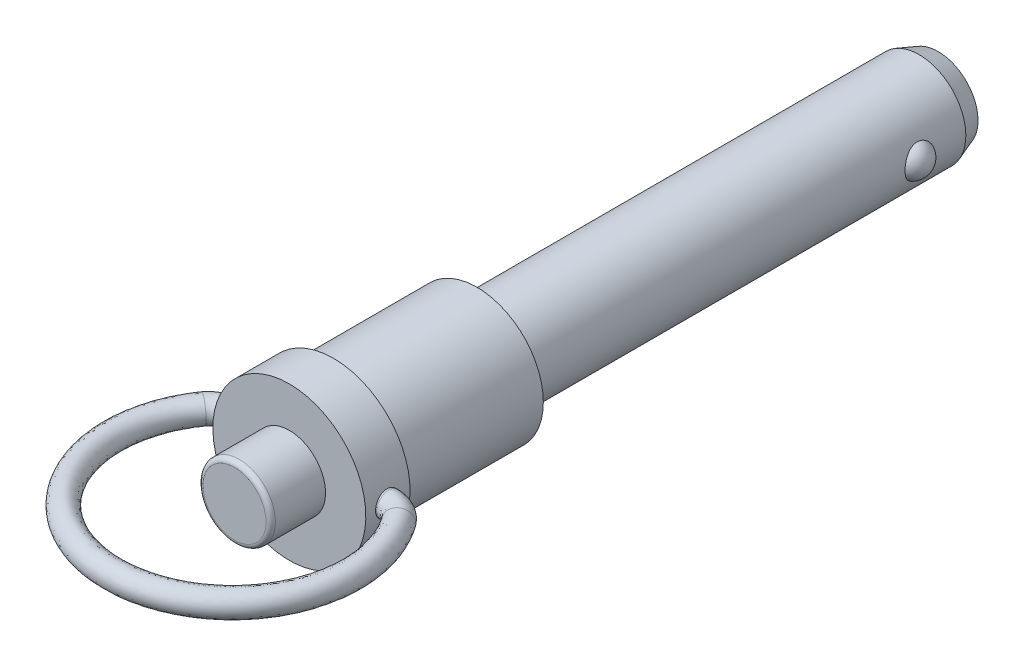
ISO-10303-21;
HEADER;
FILE_DESCRIPTION(('STEP AP214'),'2;1');
FILE_NAME('part.step','',(''),(''),'','','');
FILE_SCHEMA(('AUTOMOTIVE_DESIGN { 1 0 10303 214 1 1 1 1 }'));
ENDSEC;
DATA;
#1=APPLICATION_CONTEXT('core data for automotive mechanical design processes');
#2=APPLICATION_PROTOCOL_DEFINITION('international standard','automotive_design',2000,#1);
#3=PRODUCT_CONTEXT('',#1,'mechanical');
#4=PRODUCT('Part','Part','',(#3));
#5=PRODUCT_RELATED_PRODUCT_CATEGORY('part','',(#4));
#6=PRODUCT_DEFINITION_FORMATION('','',#4);
#7=PRODUCT_DEFINITION_CONTEXT('part definition',#1,'design');
#8=PRODUCT_DEFINITION('design','',#6,#7);
#9=PRODUCT_DEFINITION_SHAPE('','',#8);
#10=(LENGTH_UNIT() NAMED_UNIT(*) SI_UNIT(.MILLI.,.METRE.));
#11=(NAMED_UNIT(*) PLANE_ANGLE_UNIT() SI_UNIT($,.RADIAN.));
#12=(NAMED_UNIT(*) SI_UNIT($,.STERADIAN.) SOLID_ANGLE_UNIT());
#13=UNCERTAINTY_MEASURE_WITH_UNIT(LENGTH_MEASURE(1.E-05),#10,'distance_accuracy_value','');
#14=(GEOMETRIC_REPRESENTATION_CONTEXT(3) GLOBAL_UNCERTAINTY_ASSIGNED_CONTEXT((#13)) GLOBAL_UNIT_ASSIGNED_CONTEXT((#10,
#11,#12)) REPRESENTATION_CONTEXT('',''));
#15=CARTESIAN_POINT('',(0.,0.,0.));
#16=DIRECTION('',(0.,0.,1.));
#17=DIRECTION('',(1.,0.,0.));
#18=AXIS2_PLACEMENT_3D('',#15,#16,#17);
#19=CARTESIAN_POINT('',(0.,0.,25.765));
#20=DIRECTION('',(0.,0.,1.));
#21=DIRECTION('',(1.,0.,0.));
#22=AXIS2_PLACEMENT_3D('',#19,#20,#21);
#23=PLANE('',#22);
#24=CARTESIAN_POINT('',(0.,0.,25.765));
#25=DIRECTION('',(0.,0.,1.));
#26=DIRECTION('',(1.,0.,0.));
#27=AXIS2_PLACEMENT_3D('',#24,#25,#26);
#28=CIRCLE('',#27,3.3481);
#29=CARTESIAN_POINT('',(3.3481,0.,25.765));
#30=VERTEX_POINT('',#29);
#31=EDGE_CURVE('E140',#30,#30,#28,.T.);
#32=ORIENTED_EDGE('',*,*,#31,.T.);
#33=EDGE_LOOP('',(#32));
#34=FACE_BOUND('',#33,.T.);
#35=ADVANCED_FACE('F12',(#34),#23,.T.);
#36=CARTESIAN_POINT('',(0.,0.,25.265));
#37=DIRECTION('',(0.,0.,1.));
#38=DIRECTION('',(1.,0.,0.));
#39=AXIS2_PLACEMENT_3D('',#36,#37,#38);
#40=TOROIDAL_SURFACE('',#39,3.3481,0.5);
#41=CARTESIAN_POINT('',(0.,0.,25.265));
#42=DIRECTION('',(0.,0.,1.));
#43=DIRECTION('',(1.,0.,0.));
#44=AXIS2_PLACEMENT_3D('',#41,#42,#43);
#45=CIRCLE('',#44,3.8481);
#46=CARTESIAN_POINT('',(3.8481,0.,25.265));
#47=VERTEX_POINT('',#46);
#48=EDGE_CURVE('E137',#47,#47,#45,.T.);
#49=ORIENTED_EDGE('',*,*,#48,.T.);
#50=EDGE_LOOP('',(#49));
#51=FACE_BOUND('',#50,.T.);
#52=ORIENTED_EDGE('',*,*,#31,.F.);
#53=EDGE_LOOP('',(#52));
#54=FACE_BOUND('',#53,.T.);
#55=ADVANCED_FACE('F75',(#51,#54),#40,.T.);
#56=CARTESIAN_POINT('',(11.4497733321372,0.,17.9437724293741));
#57=CARTESIAN_POINT('',(11.8265676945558,0.,18.4801460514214));
#58=CARTESIAN_POINT('',(12.6551080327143,0.,19.8662433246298));
#59=CARTESIAN_POINT('',(13.4882796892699,0.,22.0133244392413));
#60=CARTESIAN_POINT('',(14.0014195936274,0.,24.4938075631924));
#61=CARTESIAN_POINT('',(14.0399868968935,0.,27.1482100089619));
#62=CARTESIAN_POINT('',(13.5501253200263,0.,29.8733661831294));
#63=CARTESIAN_POINT('',(12.5103672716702,0.,32.4943169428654));
#64=CARTESIAN_POINT('',(10.9649059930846,0.,34.8529407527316));
#65=CARTESIAN_POINT('',(9.01915526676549,0.,36.8217510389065));
#66=CARTESIAN_POINT('',(6.82219687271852,0.,38.3176313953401));
#67=CARTESIAN_POINT('',(4.51156788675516,0.,39.3254677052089));
#68=CARTESIAN_POINT('',(2.23137128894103,0.,39.879227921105));
#69=CARTESIAN_POINT('',(7.28333001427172E-13,0.,40.0580345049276));
#70=CARTESIAN_POINT('',(-2.23137128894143,0.,39.879227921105));
#71=CARTESIAN_POINT('',(-4.51156788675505,0.,39.3254677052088));
#72=CARTESIAN_POINT('',(-6.82219687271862,0.,38.31763139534));
#73=CARTESIAN_POINT('',(-9.01915526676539,0.,36.8217510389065));
#74=CARTESIAN_POINT('',(-10.9649059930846,0.,34.8529407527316));
#75=CARTESIAN_POINT('',(-12.5103672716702,0.,32.4943169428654));
#76=CARTESIAN_POINT('',(-13.5501253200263,0.,29.8733661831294));
#77=CARTESIAN_POINT('',(-14.0399868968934,0.,27.148210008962));
#78=CARTESIAN_POINT('',(-14.0014195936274,0.,24.4938075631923));
#79=CARTESIAN_POINT('',(-13.4882796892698,0.,22.0133244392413));
#80=CARTESIAN_POINT('',(-12.6551080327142,0.,19.8662433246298));
#81=CARTESIAN_POINT('',(-11.8265676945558,0.,18.4801460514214));
#82=CARTESIAN_POINT('',(-11.4497733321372,0.,17.9437724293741));
#83=CARTESIAN_POINT('',(11.4497733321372,-2.59999999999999,17.9437724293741));
#84=CARTESIAN_POINT('',(11.7096770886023,-2.59999999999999,18.3137501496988));
#85=CARTESIAN_POINT('',(12.7137877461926,-2.59999999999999,19.9497749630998));
#86=CARTESIAN_POINT('',(13.4708176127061,-2.59999999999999,21.9884668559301));
#87=CARTESIAN_POINT('',(14.0065482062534,-2.6,24.5011082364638));
#88=CARTESIAN_POINT('',(14.0385176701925,-2.59999999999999,27.1461185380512));
#89=CARTESIAN_POINT('',(13.5505344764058,-2.59999999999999,29.8739486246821));
#90=CARTESIAN_POINT('',(12.5102566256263,-2.59999999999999,32.4941594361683));
#91=CARTESIAN_POINT('',(10.9649350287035,-2.59999999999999,34.8529820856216));
#92=CARTESIAN_POINT('',(9.01914786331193,-2.6,36.8217404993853));
#93=CARTESIAN_POINT('',(6.82219870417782,-2.59999999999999,38.3176340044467));
#94=CARTESIAN_POINT('',(4.51156744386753,-2.59999999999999,39.3254670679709));
#95=CARTESIAN_POINT('',(2.23137138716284,-2.59999999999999,39.879228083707));
#96=CARTESIAN_POINT('',(7.28268272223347E-13,-2.59999999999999,40.0580344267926));
#97=CARTESIAN_POINT('',(-2.23137138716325,-2.6,39.879228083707));
#98=CARTESIAN_POINT('',(-4.51156744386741,-2.59999999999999,39.3254670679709));
#99=CARTESIAN_POINT('',(-6.82219870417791,-2.6,38.3176340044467));
#100=CARTESIAN_POINT('',(-9.01914786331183,-2.59999999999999,36.8217404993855));
#101=CARTESIAN_POINT('',(-10.9649350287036,-2.59999999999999,34.8529820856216));
#102=CARTESIAN_POINT('',(-12.5102566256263,-2.59999999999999,32.4941594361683));
#103=CARTESIAN_POINT('',(-13.5505344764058,-2.59999999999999,29.8739486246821));
#104=CARTESIAN_POINT('',(-14.0385176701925,-2.6,27.1461185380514));
#105=CARTESIAN_POINT('',(-14.0065482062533,-2.59999999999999,24.5011082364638));
#106=CARTESIAN_POINT('',(-13.4708176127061,-2.59999999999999,21.9884668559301));
#107=CARTESIAN_POINT('',(-12.7137877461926,-2.59999999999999,19.9497749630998));
#108=CARTESIAN_POINT('',(-11.7096770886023,-2.59999999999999,18.3137501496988));
#109=CARTESIAN_POINT('',(-11.4497733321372,-2.59999999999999,17.9437724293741));
#110=CARTESIAN_POINT('',(9.33442519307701,-2.59999999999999,19.4556422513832));
#111=CARTESIAN_POINT('',(9.59432894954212,-2.59999999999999,19.8256199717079));
#112=CARTESIAN_POINT('',(10.3328710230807,-2.59999999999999,21.0505437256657));
#113=CARTESIAN_POINT('',(10.9823054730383,-2.59999999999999,22.7644201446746));
#114=CARTESIAN_POINT('',(11.4042672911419,-2.6,24.7888114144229));
#115=CARTESIAN_POINT('',(11.4306312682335,-2.59999999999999,26.9493701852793));
#116=CARTESIAN_POINT('',(11.0308912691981,-2.59999999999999,29.1626260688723));
#117=CARTESIAN_POINT('',(10.1828123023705,-2.59999999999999,31.2968985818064));
#118=CARTESIAN_POINT('',(8.92160036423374,-2.59999999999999,33.2166725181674));
#119=CARTESIAN_POINT('',(7.34098330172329,-2.6,34.8144779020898));
#120=CARTESIAN_POINT('',(5.5491258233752,-2.59999999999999,36.0332448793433));
#121=CARTESIAN_POINT('',(3.67550207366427,-2.59999999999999,36.8497543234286));
#122=CARTESIAN_POINT('',(1.8109997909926,-2.59999999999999,37.3021941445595));
#123=CARTESIAN_POINT('',(-9.61358135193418E-13,-2.59999999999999,37.4469985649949));
#124=CARTESIAN_POINT('',(-1.81099979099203,-2.6,37.3021941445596));
#125=CARTESIAN_POINT('',(-3.6755020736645,-2.59999999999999,36.8497543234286));
#126=CARTESIAN_POINT('',(-5.54912582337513,-2.6,36.0332448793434));
#127=CARTESIAN_POINT('',(-7.34098330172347,-2.59999999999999,34.8144779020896));
#128=CARTESIAN_POINT('',(-8.92160036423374,-2.59999999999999,33.2166725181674));
#129=CARTESIAN_POINT('',(-10.1828123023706,-2.59999999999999,31.2968985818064));
#130=CARTESIAN_POINT('',(-11.0308912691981,-2.59999999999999,29.1626260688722));
#131=CARTESIAN_POINT('',(-11.4306312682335,-2.6,26.9493701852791));
#132=CARTESIAN_POINT('',(-11.4042672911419,-2.59999999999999,24.7888114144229));
#133=CARTESIAN_POINT('',(-10.9823054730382,-2.59999999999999,22.7644201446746));
#134=CARTESIAN_POINT('',(-10.3328710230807,-2.59999999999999,21.0505437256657));
#135=CARTESIAN_POINT('',(-9.59432894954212,-2.59999999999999,19.8256199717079));
#136=CARTESIAN_POINT('',(-9.33442519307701,-2.59999999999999,19.4556422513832));
#137=CARTESIAN_POINT('',(9.33442519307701,0.,19.4556422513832));
#138=CARTESIAN_POINT('',(9.65277425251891,0.,19.9088179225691));
#139=CARTESIAN_POINT('',(10.3035311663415,0.,21.0087779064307));
#140=CARTESIAN_POINT('',(10.9910365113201,0.,22.7768489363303));
#141=CARTESIAN_POINT('',(11.4017029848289,0.,24.7851610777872));
#142=CARTESIAN_POINT('',(11.431365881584,0.,26.9504159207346));
#143=CARTESIAN_POINT('',(11.0306866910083,0.,29.1623348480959));
#144=CARTESIAN_POINT('',(10.1828676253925,0.,31.2969773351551));
#145=CARTESIAN_POINT('',(8.92158584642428,0.,33.2166518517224));
#146=CARTESIAN_POINT('',(7.34098700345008,0.,34.8144831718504));
#147=CARTESIAN_POINT('',(5.54912490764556,0.,36.03324357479));
#148=CARTESIAN_POINT('',(3.67550229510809,0.,36.8497546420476));
#149=CARTESIAN_POINT('',(1.8109997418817,0.,37.3021940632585));
#150=CARTESIAN_POINT('',(-9.6127182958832E-13,0.,37.4469986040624));
#151=CARTESIAN_POINT('',(-1.81099974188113,0.,37.3021940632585));
#152=CARTESIAN_POINT('',(-3.67550229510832,0.,36.8497546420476));
#153=CARTESIAN_POINT('',(-5.54912490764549,0.,36.03324357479));
#154=CARTESIAN_POINT('',(-7.34098700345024,0.,34.8144831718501));
#155=CARTESIAN_POINT('',(-8.92158584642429,0.,33.2166518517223));
#156=CARTESIAN_POINT('',(-10.1828676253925,0.,31.296977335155));
#157=CARTESIAN_POINT('',(-11.0306866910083,0.,29.1623348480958));
#158=CARTESIAN_POINT('',(-11.431365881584,0.,26.9504159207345));
#159=CARTESIAN_POINT('',(-11.4017029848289,0.,24.7851610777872));
#160=CARTESIAN_POINT('',(-10.9910365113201,0.,22.7768489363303));
#161=CARTESIAN_POINT('',(-10.3035311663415,0.,21.0087779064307));
#162=CARTESIAN_POINT('',(-9.6527742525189,0.,19.9088179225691));
#163=CARTESIAN_POINT('',(-9.33442519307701,0.,19.4556422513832));
#164=CARTESIAN_POINT('',(9.33442519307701,2.59999999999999,19.4556422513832));
#165=CARTESIAN_POINT('',(9.7112195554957,2.59999999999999,19.9920158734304));
#166=CARTESIAN_POINT('',(10.2741913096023,2.59999999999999,20.9670120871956));
#167=CARTESIAN_POINT('',(10.999767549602,2.59999999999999,22.7892777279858));
#168=CARTESIAN_POINT('',(11.3991386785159,2.6,24.7815107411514));
#169=CARTESIAN_POINT('',(11.4321004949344,2.59999999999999,26.9514616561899));
#170=CARTESIAN_POINT('',(11.0304821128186,2.59999999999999,29.1620436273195));
#171=CARTESIAN_POINT('',(10.1829229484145,2.59999999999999,31.2970560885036));
#172=CARTESIAN_POINT('',(8.92157132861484,2.59999999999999,33.2166311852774));
#173=CARTESIAN_POINT('',(7.34099070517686,2.6,34.8144884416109));
#174=CARTESIAN_POINT('',(5.54912399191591,2.59999999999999,36.0332422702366));
#175=CARTESIAN_POINT('',(3.67550251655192,2.59999999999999,36.8497549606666));
#176=CARTESIAN_POINT('',(1.81099969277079,2.59999999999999,37.3021939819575));
#177=CARTESIAN_POINT('',(-9.61422864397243E-13,2.59999999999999,37.4469986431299));
#178=CARTESIAN_POINT('',(-1.81099969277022,2.6,37.3021939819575));
#179=CARTESIAN_POINT('',(-3.67550251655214,2.59999999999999,36.8497549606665));
#180=CARTESIAN_POINT('',(-5.54912399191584,2.6,36.0332422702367));
#181=CARTESIAN_POINT('',(-7.34099070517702,2.59999999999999,34.8144884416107));
#182=CARTESIAN_POINT('',(-8.92157132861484,2.59999999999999,33.2166311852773));
#183=CARTESIAN_POINT('',(-10.1829229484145,2.59999999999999,31.2970560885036));
#184=CARTESIAN_POINT('',(-11.0304821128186,2.59999999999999,29.1620436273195));
#185=CARTESIAN_POINT('',(-11.4321004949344,2.6,26.9514616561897));
#186=CARTESIAN_POINT('',(-11.3991386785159,2.59999999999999,24.7815107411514));
#187=CARTESIAN_POINT('',(-10.999767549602,2.59999999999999,22.7892777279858));
#188=CARTESIAN_POINT('',(-10.2741913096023,2.59999999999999,20.9670120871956));
#189=CARTESIAN_POINT('',(-9.71121955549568,2.59999999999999,19.9920158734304));
#190=CARTESIAN_POINT('',(-9.33442519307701,2.59999999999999,19.4556422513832));
#191=CARTESIAN_POINT('',(11.4497733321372,2.59999999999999,17.9437724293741));
#192=CARTESIAN_POINT('',(11.9434583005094,2.59999999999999,18.6465419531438));
#193=CARTESIAN_POINT('',(12.5964283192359,2.59999999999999,19.7827116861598));
#194=CARTESIAN_POINT('',(13.5057417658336,2.59999999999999,22.0381820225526));
#195=CARTESIAN_POINT('',(13.9962909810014,2.6,24.4865068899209));
#196=CARTESIAN_POINT('',(14.0414561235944,2.59999999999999,27.1503014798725));
#197=CARTESIAN_POINT('',(13.5497161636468,2.59999999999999,29.8727837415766));
#198=CARTESIAN_POINT('',(12.5104779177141,2.59999999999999,32.4944744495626));
#199=CARTESIAN_POINT('',(10.9648769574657,2.59999999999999,34.8528994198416));
#200=CARTESIAN_POINT('',(9.01916267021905,2.6,36.8217615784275));
#201=CARTESIAN_POINT('',(6.82219504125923,2.59999999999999,38.3176287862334));
#202=CARTESIAN_POINT('',(4.5115683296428,2.59999999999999,39.3254683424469));
#203=CARTESIAN_POINT('',(2.23137119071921,2.59999999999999,39.8792277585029));
#204=CARTESIAN_POINT('',(7.28203543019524E-13,2.59999999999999,40.0580345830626));
#205=CARTESIAN_POINT('',(-2.23137119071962,2.6,39.879227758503));
#206=CARTESIAN_POINT('',(-4.51156832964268,2.59999999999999,39.3254683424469));
#207=CARTESIAN_POINT('',(-6.82219504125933,2.6,38.3176287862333));
#208=CARTESIAN_POINT('',(-9.01916267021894,2.59999999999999,36.8217615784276));
#209=CARTESIAN_POINT('',(-10.9648769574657,2.59999999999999,34.8528994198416));
#210=CARTESIAN_POINT('',(-12.5104779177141,2.59999999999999,32.4944744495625));
#211=CARTESIAN_POINT('',(-13.5497161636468,2.59999999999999,29.8727837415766));
#212=CARTESIAN_POINT('',(-14.0414561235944,2.6,27.1503014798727));
#213=CARTESIAN_POINT('',(-13.9962909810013,2.59999999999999,24.4865068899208));
#214=CARTESIAN_POINT('',(-13.5057417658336,2.59999999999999,22.0381820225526));
#215=CARTESIAN_POINT('',(-12.5964283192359,2.59999999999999,19.7827116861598));
#216=CARTESIAN_POINT('',(-11.9434583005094,2.59999999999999,18.6465419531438));
#217=CARTESIAN_POINT('',(-11.4497733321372,2.59999999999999,17.9437724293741));
#218=CARTESIAN_POINT('',(11.4497733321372,0.,17.9437724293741));
#219=CARTESIAN_POINT('',(11.8265676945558,0.,18.4801460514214));
#220=CARTESIAN_POINT('',(12.6551080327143,0.,19.8662433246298));
#221=CARTESIAN_POINT('',(13.4882796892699,0.,22.0133244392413));
#222=CARTESIAN_POINT('',(14.0014195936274,0.,24.4938075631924));
#223=CARTESIAN_POINT('',(14.0399868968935,0.,27.1482100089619));
#224=CARTESIAN_POINT('',(13.5501253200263,0.,29.8733661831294));
#225=CARTESIAN_POINT('',(12.5103672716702,0.,32.4943169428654));
#226=CARTESIAN_POINT('',(10.9649059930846,0.,34.8529407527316));
#227=CARTESIAN_POINT('',(9.01915526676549,0.,36.8217510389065));
#228=CARTESIAN_POINT('',(6.82219687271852,0.,38.3176313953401));
#229=CARTESIAN_POINT('',(4.51156788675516,0.,39.3254677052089));
#230=CARTESIAN_POINT('',(2.23137128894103,0.,39.879227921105));
#231=CARTESIAN_POINT('',(7.28333001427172E-13,0.,40.0580345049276));
#232=CARTESIAN_POINT('',(-2.23137128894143,0.,39.879227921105));
#233=CARTESIAN_POINT('',(-4.51156788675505,0.,39.3254677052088));
#234=CARTESIAN_POINT('',(-6.82219687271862,0.,38.31763139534));
#235=CARTESIAN_POINT('',(-9.01915526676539,0.,36.8217510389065));
#236=CARTESIAN_POINT('',(-10.9649059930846,0.,34.8529407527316));
#237=CARTESIAN_POINT('',(-12.5103672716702,0.,32.4943169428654));
#238=CARTESIAN_POINT('',(-13.5501253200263,0.,29.8733661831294));
#239=CARTESIAN_POINT('',(-14.0399868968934,0.,27.148210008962));
#240=CARTESIAN_POINT('',(-14.0014195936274,0.,24.4938075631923));
#241=CARTESIAN_POINT('',(-13.4882796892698,0.,22.0133244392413));
#242=CARTESIAN_POINT('',(-12.6551080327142,0.,19.8662433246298));
#243=CARTESIAN_POINT('',(-11.8265676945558,0.,18.4801460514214));
#244=CARTESIAN_POINT('',(-11.4497733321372,0.,17.9437724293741));
#245=(BOUNDED_SURFACE() B_SPLINE_SURFACE(3,3,((#56,#57,#58,#59,#60,#61,#62,#63,#64,#65,#66,#67,
#68,#69,#70,#71,#72,#73,#74,#75,#76,#77,#78,#79,#80,#81,#82),(#83,#84,#85,#86,#87,#88,#89,#90,
#91,#92,#93,#94,#95,#96,#97,#98,#99,#100,#101,#102,#103,#104,#105,#106,#107,#108,#109),(#110,
#111,#112,#113,#114,#115,#116,#117,#118,#119,#120,#121,#122,#123,#124,#125,#126,#127,#128,#129,
#130,#131,#132,#133,#134,#135,#136),(#137,#138,#139,#140,#141,#142,#143,#144,#145,#146,#147,
#148,#149,#150,#151,#152,#153,#154,#155,#156,#157,#158,#159,#160,#161,#162,#163),(#164,#165,
#166,#167,#168,#169,#170,#171,#172,#173,#174,#175,#176,#177,#178,#179,#180,#181,#182,#183,#184,
#185,#186,#187,#188,#189,#190),(#191,#192,#193,#194,#195,#196,#197,#198,#199,#200,#201,#202,
#203,#204,#205,#206,#207,#208,#209,#210,#211,#212,#213,#214,#215,#216,#217),(#218,#219,#220,
#221,#222,#223,#224,#225,#226,#227,#228,#229,#230,#231,#232,#233,#234,#235,#236,#237,#238,#239,
#240,#241,#242,#243,#244)),.UNSPECIFIED.,.T.,.F.,.F.) B_SPLINE_SURFACE_WITH_KNOTS((4,3,4),(4,1,
1,1,1,1,1,1,1,1,1,1,1,1,1,1,1,1,1,1,1,1,1,1,4),(0.,0.5,1.),(0.,0.0355177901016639,
0.0739139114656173,0.114982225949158,0.158533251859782,0.203808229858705,0.250000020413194,
0.296191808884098,0.34146678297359,0.385017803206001,0.426086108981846,0.464482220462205,0.5,
0.535517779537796,0.573913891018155,0.614982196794,0.658533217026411,0.703808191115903,
0.749999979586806,0.796191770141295,0.841466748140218,0.885017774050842,0.926086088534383,
0.964482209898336,1.),
.UNSPECIFIED.) GEOMETRIC_REPRESENTATION_ITEM() RATIONAL_B_SPLINE_SURFACE(((1.,1.,1.,1.,1.,1.,1.,
1.,1.,1.,1.,1.,1.,1.,1.,1.,1.,1.,1.,1.,1.,1.,1.,1.,1.,1.,1.),(0.333333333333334,
0.333333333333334,0.333333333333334,0.333333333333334,0.333333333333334,0.333333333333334,
0.333333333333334,0.333333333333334,0.333333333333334,0.333333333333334,0.333333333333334,
0.333333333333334,0.333333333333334,0.333333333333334,0.333333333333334,0.333333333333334,
0.333333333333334,0.333333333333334,0.333333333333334,0.333333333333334,0.333333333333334,
0.333333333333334,0.333333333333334,0.333333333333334,0.333333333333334,0.333333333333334,
0.333333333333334),(0.333333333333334,0.333333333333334,0.333333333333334,0.333333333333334,
0.333333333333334,0.333333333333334,0.333333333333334,0.333333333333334,0.333333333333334,
0.333333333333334,0.333333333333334,0.333333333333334,0.333333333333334,0.333333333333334,
0.333333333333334,0.333333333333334,0.333333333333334,0.333333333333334,0.333333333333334,
0.333333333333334,0.333333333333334,0.333333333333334,0.333333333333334,0.333333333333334,
0.333333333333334,0.333333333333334,0.333333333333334),(1.,1.,1.,1.,1.,1.,1.,1.,1.,1.,1.,1.,1.,
1.,1.,1.,1.,1.,1.,1.,1.,1.,1.,1.,1.,1.,1.),(0.333333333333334,0.333333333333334,
0.333333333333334,0.333333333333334,0.333333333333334,0.333333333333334,0.333333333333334,
0.333333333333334,0.333333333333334,0.333333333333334,0.333333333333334,0.333333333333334,
0.333333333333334,0.333333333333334,0.333333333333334,0.333333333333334,0.333333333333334,
0.333333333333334,0.333333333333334,0.333333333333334,0.333333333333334,0.333333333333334,
0.333333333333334,0.333333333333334,0.333333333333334,0.333333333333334,0.333333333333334),
(0.333333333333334,0.333333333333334,0.333333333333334,0.333333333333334,0.333333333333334,
0.333333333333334,0.333333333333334,0.333333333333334,0.333333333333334,0.333333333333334,
0.333333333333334,0.333333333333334,0.333333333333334,0.333333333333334,0.333333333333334,
0.333333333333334,0.333333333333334,0.333333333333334,0.333333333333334,0.333333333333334,
0.333333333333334,0.333333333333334,0.333333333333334,0.333333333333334,0.333333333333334,
0.333333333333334,0.333333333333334),(1.,1.,1.,1.,1.,1.,1.,1.,1.,1.,1.,1.,1.,1.,1.,1.,1.,1.,1.,
1.,1.,1.,1.,1.,1.,1.,1.))) REPRESENTATION_ITEM('') SURFACE());
#246=CARTESIAN_POINT('',(11.4497733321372,0.,17.9437724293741));
#247=CARTESIAN_POINT('',(11.4497733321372,-2.59999999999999,17.9437724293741));
#248=CARTESIAN_POINT('',(9.33442519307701,-2.59999999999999,19.4556422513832));
#249=CARTESIAN_POINT('',(9.33442519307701,0.,19.4556422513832));
#250=CARTESIAN_POINT('',(9.33442519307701,2.59999999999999,19.4556422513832));
#251=CARTESIAN_POINT('',(11.4497733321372,2.59999999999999,17.9437724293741));
#252=CARTESIAN_POINT('',(11.4497733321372,0.,17.9437724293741));
#253=(BOUNDED_CURVE() B_SPLINE_CURVE(3,(#246,#247,#248,#249,#250,#251,#252),.UNSPECIFIED.,.T.,
.F.) B_SPLINE_CURVE_WITH_KNOTS((4,3,4),(0.,0.5,1.),
.UNSPECIFIED.) CURVE() GEOMETRIC_REPRESENTATION_ITEM() RATIONAL_B_SPLINE_CURVE((1.,
0.333333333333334,0.333333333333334,1.,0.333333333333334,0.333333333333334,1.)) REPRESENTATION_ITEM(''));
#254=CARTESIAN_POINT('',(11.4497733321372,0.,17.9437724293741));
#255=VERTEX_POINT('',#254);
#256=EDGE_CURVE('E175',#255,#255,#253,.T.);
#257=CARTESIAN_POINT('',(-11.4497733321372,0.,17.9437724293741));
#258=CARTESIAN_POINT('',(-11.4497733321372,-2.59999999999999,17.9437724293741));
#259=CARTESIAN_POINT('',(-9.33442519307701,-2.59999999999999,19.4556422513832));
#260=CARTESIAN_POINT('',(-9.33442519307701,0.,19.4556422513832));
#261=CARTESIAN_POINT('',(-9.33442519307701,2.59999999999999,19.4556422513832));
#262=CARTESIAN_POINT('',(-11.4497733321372,2.59999999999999,17.9437724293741));
#263=CARTESIAN_POINT('',(-11.4497733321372,0.,17.9437724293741));
#264=(BOUNDED_CURVE() B_SPLINE_CURVE(3,(#257,#258,#259,#260,#261,#262,#263),.UNSPECIFIED.,.T.,
.F.) B_SPLINE_CURVE_WITH_KNOTS((4,3,4),(0.,0.5,1.),
.UNSPECIFIED.) CURVE() GEOMETRIC_REPRESENTATION_ITEM() RATIONAL_B_SPLINE_CURVE((1.,
0.333333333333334,0.333333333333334,1.,0.333333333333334,0.333333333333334,1.)) REPRESENTATION_ITEM(''));
#265=CARTESIAN_POINT('',(-11.4497733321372,0.,17.9437724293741));
#266=VERTEX_POINT('',#265);
#267=EDGE_CURVE('E173',#266,#266,#264,.F.);
#268=ORIENTED_EDGE('',*,*,#256,.F.);
#269=EDGE_LOOP('',(#268));
#270=FACE_BOUND('',#269,.T.);
#271=ORIENTED_EDGE('',*,*,#267,.F.);
#272=EDGE_LOOP('',(#271));
#273=FACE_BOUND('',#272,.T.);
#274=ADVANCED_FACE('F81',(#270,#273),#245,.F.);
#275=CARTESIAN_POINT('',(8.23717073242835,0.,16.3022));
#276=CARTESIAN_POINT('',(8.39026579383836,0.,16.3022));
#277=CARTESIAN_POINT('',(8.96971374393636,0.,16.3453113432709));
#278=CARTESIAN_POINT('',(9.59211406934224,0.,16.5211040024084));
#279=CARTESIAN_POINT('',(10.3031381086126,0.,16.8555507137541));
#280=CARTESIAN_POINT('',(10.8955792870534,0.,17.2786190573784));
#281=CARTESIAN_POINT('',(11.3434296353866,0.,17.7975125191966));
#282=CARTESIAN_POINT('',(11.4497733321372,0.,17.9437724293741));
#283=CARTESIAN_POINT('',(8.23717073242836,2.59999999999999,16.3022));
#284=CARTESIAN_POINT('',(8.16213736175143,2.59999999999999,16.3022));
#285=CARTESIAN_POINT('',(9.0792865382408,2.59999999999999,16.3469383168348));
#286=CARTESIAN_POINT('',(9.55822083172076,2.6,16.5152316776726));
#287=CARTESIAN_POINT('',(10.3298909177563,2.59999999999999,16.879237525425));
#288=CARTESIAN_POINT('',(10.8172738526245,2.59999999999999,17.1748054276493));
#289=CARTESIAN_POINT('',(11.5008843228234,2.59999999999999,18.0140679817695));
#290=CARTESIAN_POINT('',(11.4497733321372,2.59999999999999,17.9437724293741));
#291=CARTESIAN_POINT('',(8.23717073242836,2.59999999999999,18.9022));
#292=CARTESIAN_POINT('',(8.16213736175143,2.59999999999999,18.9022));
#293=CARTESIAN_POINT('',(8.54034086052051,2.59999999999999,18.9167455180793));
#294=CARTESIAN_POINT('',(8.68812752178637,2.6,18.9762506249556));
#295=CARTESIAN_POINT('',(8.94759350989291,2.59999999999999,19.0969960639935));
#296=CARTESIAN_POINT('',(9.10292826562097,2.59999999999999,19.1770581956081));
#297=CARTESIAN_POINT('',(9.38553618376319,2.59999999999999,19.5259378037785));
#298=CARTESIAN_POINT('',(9.33442519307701,2.59999999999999,19.4556422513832));
#299=CARTESIAN_POINT('',(8.23717073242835,0.,18.9022));
#300=CARTESIAN_POINT('',(8.2762015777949,0.,18.9022));
#301=CARTESIAN_POINT('',(8.48555446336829,0.,18.9159320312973));
#302=CARTESIAN_POINT('',(8.70507414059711,0.,18.9791867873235));
#303=CARTESIAN_POINT('',(8.93421710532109,0.,19.0851526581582));
#304=CARTESIAN_POINT('',(9.14208098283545,0.,19.2289650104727));
#305=CARTESIAN_POINT('',(9.30680884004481,0.,19.4176600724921));
#306=CARTESIAN_POINT('',(9.33442519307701,0.,19.4556422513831));
#307=CARTESIAN_POINT('',(8.23717073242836,-2.59999999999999,18.9022));
#308=CARTESIAN_POINT('',(8.39026579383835,-2.59999999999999,18.9022));
#309=CARTESIAN_POINT('',(8.43076806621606,-2.59999999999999,18.9151185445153));
#310=CARTESIAN_POINT('',(8.72202075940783,-2.6,18.9821229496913));
#311=CARTESIAN_POINT('',(8.92084070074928,-2.59999999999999,19.0733092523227));
#312=CARTESIAN_POINT('',(9.1812337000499,-2.59999999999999,19.2808718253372));
#313=CARTESIAN_POINT('',(9.22808149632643,-2.59999999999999,19.3093823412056));
#314=CARTESIAN_POINT('',(9.33442519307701,-2.59999999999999,19.4556422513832));
#315=CARTESIAN_POINT('',(8.23717073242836,-2.59999999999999,16.3022));
#316=CARTESIAN_POINT('',(8.61839422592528,-2.59999999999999,16.3022));
#317=CARTESIAN_POINT('',(8.8601409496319,-2.59999999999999,16.3436843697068));
#318=CARTESIAN_POINT('',(9.6260073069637,-2.6,16.5269763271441));
#319=CARTESIAN_POINT('',(10.276385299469,-2.59999999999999,16.8318639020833));
#320=CARTESIAN_POINT('',(10.9738847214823,-2.59999999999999,17.3824326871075));
#321=CARTESIAN_POINT('',(11.1859749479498,-2.59999999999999,17.5809570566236));
#322=CARTESIAN_POINT('',(11.4497733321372,-2.59999999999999,17.9437724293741));
#323=CARTESIAN_POINT('',(8.23717073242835,0.,16.3022));
#324=CARTESIAN_POINT('',(8.39026579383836,0.,16.3022));
#325=CARTESIAN_POINT('',(8.96971374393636,0.,16.3453113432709));
#326=CARTESIAN_POINT('',(9.59211406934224,0.,16.5211040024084));
#327=CARTESIAN_POINT('',(10.3031381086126,0.,16.8555507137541));
#328=CARTESIAN_POINT('',(10.8955792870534,0.,17.2786190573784));
#329=CARTESIAN_POINT('',(11.3434296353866,0.,17.7975125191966));
#330=CARTESIAN_POINT('',(11.4497733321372,0.,17.9437724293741));
#331=(BOUNDED_SURFACE() B_SPLINE_SURFACE(3,3,((#275,#276,#277,#278,#279,#280,#281,#282),(#283,
#284,#285,#286,#287,#288,#289,#290),(#291,#292,#293,#294,#295,#296,#297,#298),(#299,#300,#301,
#302,#303,#304,#305,#306),(#307,#308,#309,#310,#311,#312,#313,#314),(#315,#316,#317,#318,#319,
#320,#321,#322),(#323,#324,#325,#326,#327,#328,#329,#330)),.UNSPECIFIED.,.T.,.F.,
.F.) B_SPLINE_SURFACE_WITH_KNOTS((4,3,4),(4,1,1,1,1,4),(0.,0.5,1.),(0.,0.183393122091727,
0.371127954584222,0.561360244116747,0.78346967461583,1.),
.UNSPECIFIED.) GEOMETRIC_REPRESENTATION_ITEM() RATIONAL_B_SPLINE_SURFACE(((1.,1.,1.,1.,1.,1.,1.,
1.),(0.333333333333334,0.333333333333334,0.333333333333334,0.333333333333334,0.333333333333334,
0.333333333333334,0.333333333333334,0.333333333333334),(0.333333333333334,0.333333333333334,
0.333333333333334,0.333333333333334,0.333333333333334,0.333333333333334,0.333333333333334,
0.333333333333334),(1.,1.,1.,1.,1.,1.,1.,1.),(0.333333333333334,0.333333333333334,
0.333333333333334,0.333333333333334,0.333333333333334,0.333333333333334,0.333333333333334,
0.333333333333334),(0.333333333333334,0.333333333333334,0.333333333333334,0.333333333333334,
0.333333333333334,0.333333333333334,0.333333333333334,0.333333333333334),(1.,1.,1.,1.,1.,1.,1.,1.))) REPRESENTATION_ITEM('') SURFACE());
#332=CARTESIAN_POINT('',(8.23717073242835,0.,17.6022));
#333=DIRECTION('',(1.,0.,0.));
#334=DIRECTION('',(0.,0.,-1.));
#335=AXIS2_PLACEMENT_3D('',#332,#333,#334);
#336=CIRCLE('',#335,1.3);
#337=CARTESIAN_POINT('',(8.23717073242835,0.,16.3022));
#338=VERTEX_POINT('',#337);
#339=EDGE_CURVE('E111',#338,#338,#336,.T.);
#340=ORIENTED_EDGE('',*,*,#339,.T.);
#341=EDGE_LOOP('',(#340));
#342=FACE_BOUND('',#341,.T.);
#343=ORIENTED_EDGE('',*,*,#256,.T.);
#344=EDGE_LOOP('',(#343));
#345=FACE_BOUND('',#344,.T.);
#346=ADVANCED_FACE('F91',(#342,#345),#331,.T.);
#347=CARTESIAN_POINT('',(0.,0.,24.765));
#348=DIRECTION('',(0.,0.,-1.));
#349=DIRECTION('',(0.,1.,0.));
#350=AXIS2_PLACEMENT_3D('',#347,#348,#349);
#351=CYLINDRICAL_SURFACE('',#350,3.8481);
#352=CARTESIAN_POINT('',(0.,0.,19.939));
#353=DIRECTION('',(0.,0.,-1.));
#354=DIRECTION('',(0.,1.,0.));
#355=AXIS2_PLACEMENT_3D('',#352,#353,#354);
#356=CIRCLE('',#355,3.8481);
#357=CARTESIAN_POINT('',(0.,3.8481,19.939));
#358=VERTEX_POINT('',#357);
#359=EDGE_CURVE('E147',#358,#358,#356,.T.);
#360=ORIENTED_EDGE('',*,*,#359,.F.);
#361=EDGE_LOOP('',(#360));
#362=FACE_BOUND('',#361,.T.);
#363=ORIENTED_EDGE('',*,*,#48,.F.);
#364=EDGE_LOOP('',(#363));
#365=FACE_BOUND('',#364,.T.);
#366=ADVANCED_FACE('F87',(#362,#365),#351,.T.);
#367=CARTESIAN_POINT('',(-11.4497733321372,0.,17.9437724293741));
#368=CARTESIAN_POINT('',(-11.3597411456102,0.,17.8199465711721));
#369=CARTESIAN_POINT('',(-10.985804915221,0.,17.3752654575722));
#370=CARTESIAN_POINT('',(-10.4784291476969,0.,16.9741029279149));
#371=CARTESIAN_POINT('',(-9.7908926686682,0.,16.5936956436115));
#372=CARTESIAN_POINT('',(-9.10089921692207,0.,16.3618307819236));
#373=CARTESIAN_POINT('',(-8.41800257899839,0.,16.3022));
#374=CARTESIAN_POINT('',(-8.23717073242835,0.,16.3022));
#375=CARTESIAN_POINT('',(-11.4497733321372,2.59999999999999,17.9437724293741));
#376=CARTESIAN_POINT('',(-11.4938947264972,2.59999999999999,18.0044548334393));
#377=CARTESIAN_POINT('',(-10.9200537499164,2.59999999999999,17.2876012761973));
#378=CARTESIAN_POINT('',(-10.503110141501,2.6,16.9980618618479));
#379=CARTESIAN_POINT('',(-9.75600116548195,2.59999999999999,16.585987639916));
#380=CARTESIAN_POINT('',(-9.23091765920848,2.59999999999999,16.3641146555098));
#381=CARTESIAN_POINT('',(-8.15024985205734,2.59999999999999,16.3022));
#382=CARTESIAN_POINT('',(-8.23717073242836,2.59999999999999,16.3022));
#383=CARTESIAN_POINT('',(-9.33442519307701,2.59999999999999,19.4556422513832));
#384=CARTESIAN_POINT('',(-9.37854658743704,2.59999999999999,19.5163246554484));
#385=CARTESIAN_POINT('',(-9.14268985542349,2.59999999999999,19.2203693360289));
#386=CARTESIAN_POINT('',(-9.00682479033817,2.6,19.1369648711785));
#387=CARTESIAN_POINT('',(-8.7554763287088,2.59999999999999,19.0001197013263));
#388=CARTESIAN_POINT('',(-8.59879927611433,2.59999999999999,18.9230559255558));
#389=CARTESIAN_POINT('',(-8.15024985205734,2.59999999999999,18.9022));
#390=CARTESIAN_POINT('',(-8.23717073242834,2.59999999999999,18.9022));
#391=CARTESIAN_POINT('',(-9.334425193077,0.,19.4556422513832));
#392=CARTESIAN_POINT('',(-9.31146979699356,0.,19.4240705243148));
#393=CARTESIAN_POINT('',(-9.17556543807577,0.,19.2642014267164));
#394=CARTESIAN_POINT('',(-8.99448429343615,0.,19.124985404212));
#395=CARTESIAN_POINT('',(-8.77292208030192,0.,19.0039737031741));
#396=CARTESIAN_POINT('',(-8.53379005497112,0.,18.9219139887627));
#397=CARTESIAN_POINT('',(-8.28412621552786,0.,18.9022));
#398=CARTESIAN_POINT('',(-8.23717073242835,0.,18.9022));
#399=CARTESIAN_POINT('',(-9.33442519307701,-2.59999999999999,19.4556422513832));
#400=CARTESIAN_POINT('',(-9.24439300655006,-2.59999999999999,19.3318163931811));
#401=CARTESIAN_POINT('',(-9.20844102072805,-2.59999999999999,19.3080335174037));
#402=CARTESIAN_POINT('',(-8.98214379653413,-2.6,19.1130059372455));
#403=CARTESIAN_POINT('',(-8.79036783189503,-2.59999999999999,19.0078277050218));
#404=CARTESIAN_POINT('',(-8.46878083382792,-2.59999999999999,18.9207720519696));
#405=CARTESIAN_POINT('',(-8.41800257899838,-2.59999999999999,18.9022));
#406=CARTESIAN_POINT('',(-8.23717073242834,-2.59999999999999,18.9022));
#407=CARTESIAN_POINT('',(-11.4497733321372,-2.59999999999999,17.9437724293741));
#408=CARTESIAN_POINT('',(-11.2255875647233,-2.59999999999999,17.6354383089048));
#409=CARTESIAN_POINT('',(-11.0515560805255,-2.59999999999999,17.4629296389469));
#410=CARTESIAN_POINT('',(-10.4537481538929,-2.6,16.9501439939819));
#411=CARTESIAN_POINT('',(-9.82578417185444,-2.59999999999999,16.6014036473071));
#412=CARTESIAN_POINT('',(-8.97088077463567,-2.59999999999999,16.3595469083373));
#413=CARTESIAN_POINT('',(-8.68575530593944,-2.59999999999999,16.3022));
#414=CARTESIAN_POINT('',(-8.23717073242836,-2.59999999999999,16.3022));
#415=CARTESIAN_POINT('',(-11.4497733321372,0.,17.9437724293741));
#416=CARTESIAN_POINT('',(-11.3597411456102,0.,17.8199465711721));
#417=CARTESIAN_POINT('',(-10.985804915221,0.,17.3752654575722));
#418=CARTESIAN_POINT('',(-10.4784291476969,0.,16.9741029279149));
#419=CARTESIAN_POINT('',(-9.7908926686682,0.,16.5936956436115));
#420=CARTESIAN_POINT('',(-9.10089921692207,0.,16.3618307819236));
#421=CARTESIAN_POINT('',(-8.41800257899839,0.,16.3022));
#422=CARTESIAN_POINT('',(-8.23717073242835,0.,16.3022));
#423=(BOUNDED_SURFACE() B_SPLINE_SURFACE(3,3,((#367,#368,#369,#370,#371,#372,#373,#374),(#375,
#376,#377,#378,#379,#380,#381,#382),(#383,#384,#385,#386,#387,#388,#389,#390),(#391,#392,#393,
#394,#395,#396,#397,#398),(#399,#400,#401,#402,#403,#404,#405,#406),(#407,#408,#409,#410,#411,
#412,#413,#414),(#415,#416,#417,#418,#419,#420,#421,#422)),.UNSPECIFIED.,.T.,.F.,
.F.) B_SPLINE_SURFACE_WITH_KNOTS((4,3,4),(4,1,1,1,1,4),(0.,0.5,1.),(0.,0.183394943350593,
0.371130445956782,0.561362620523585,0.783471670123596,1.),
.UNSPECIFIED.) GEOMETRIC_REPRESENTATION_ITEM() RATIONAL_B_SPLINE_SURFACE(((1.,1.,1.,1.,1.,1.,1.,
1.),(0.333333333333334,0.333333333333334,0.333333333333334,0.333333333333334,0.333333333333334,
0.333333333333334,0.333333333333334,0.333333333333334),(0.333333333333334,0.333333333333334,
0.333333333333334,0.333333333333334,0.333333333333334,0.333333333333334,0.333333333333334,
0.333333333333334),(1.,1.,1.,1.,1.,1.,1.,1.),(0.333333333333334,0.333333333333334,
0.333333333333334,0.333333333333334,0.333333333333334,0.333333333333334,0.333333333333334,
0.333333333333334),(0.333333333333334,0.333333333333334,0.333333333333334,0.333333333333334,
0.333333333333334,0.333333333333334,0.333333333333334,0.333333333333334),(1.,1.,1.,1.,1.,1.,1.,1.))) REPRESENTATION_ITEM('') SURFACE());
#424=CARTESIAN_POINT('',(-8.23717073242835,0.,17.6022));
#425=DIRECTION('',(-1.,0.,0.));
#426=DIRECTION('',(0.,0.,1.));
#427=AXIS2_PLACEMENT_3D('',#424,#425,#426);
#428=CIRCLE('',#427,1.3);
#429=CARTESIAN_POINT('',(-8.23717073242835,0.,18.9022));
#430=VERTEX_POINT('',#429);
#431=EDGE_CURVE('E179',#430,#430,#428,.T.);
#432=ORIENTED_EDGE('',*,*,#267,.T.);
#433=EDGE_LOOP('',(#432));
#434=FACE_BOUND('',#433,.T.);
#435=ORIENTED_EDGE('',*,*,#431,.T.);
#436=EDGE_LOOP('',(#435));
#437=FACE_BOUND('',#436,.T.);
#438=ADVANCED_FACE('F90',(#434,#437),#423,.T.);
#439=CARTESIAN_POINT('',(8.23717073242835,0.,17.6022));
#440=DIRECTION('',(-1.,0.,0.));
#441=DIRECTION('',(0.,0.,1.));
#442=AXIS2_PLACEMENT_3D('',#439,#440,#441);
#443=CYLINDRICAL_SURFACE('',#442,1.3);
#444=CARTESIAN_POINT('',(8.128,0.,18.9022));
#445=CARTESIAN_POINT('',(8.12799878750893,0.072525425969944,18.9021970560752));
#446=CARTESIAN_POINT('',(8.12701915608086,0.145091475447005,18.8961103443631));
#447=CARTESIAN_POINT('',(8.12320552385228,0.288191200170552,18.8719327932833));
#448=CARTESIAN_POINT('',(8.1203697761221,0.358722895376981,18.8538306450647));
#449=CARTESIAN_POINT('',(8.11316223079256,0.495662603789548,18.8061803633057));
#450=CARTESIAN_POINT('',(8.1087916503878,0.562073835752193,18.7766412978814));
#451=CARTESIAN_POINT('',(8.09899598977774,0.688988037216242,18.706978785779));
#452=CARTESIAN_POINT('',(8.09357104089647,0.749491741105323,18.6668566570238));
#453=CARTESIAN_POINT('',(8.08221522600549,0.863417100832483,18.5767896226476));
#454=CARTESIAN_POINT('',(8.07628069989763,0.916778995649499,18.5267695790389));
#455=CARTESIAN_POINT('',(8.06460286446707,1.01439001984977,18.4184883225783));
#456=CARTESIAN_POINT('',(8.05885956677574,1.05863859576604,18.3602266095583));
#457=CARTESIAN_POINT('',(8.04817900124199,1.1370036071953,18.2367090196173));
#458=CARTESIAN_POINT('',(8.04324646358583,1.17106147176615,18.1714155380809));
#459=CARTESIAN_POINT('',(8.03479635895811,1.22770383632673,18.0359425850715));
#460=CARTESIAN_POINT('',(8.03127870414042,1.25028904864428,17.9657634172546));
#461=CARTESIAN_POINT('',(8.02609290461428,1.28315781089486,17.8231426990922));
#462=CARTESIAN_POINT('',(8.02440930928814,1.29354418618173,17.7507254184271));
#463=CARTESIAN_POINT('',(8.02303544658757,1.30203914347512,17.6051578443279));
#464=CARTESIAN_POINT('',(8.02334504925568,1.30014852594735,17.532007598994));
#465=CARTESIAN_POINT('',(8.02590848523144,1.28422703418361,17.3877813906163));
#466=CARTESIAN_POINT('',(8.02814388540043,1.27031125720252,17.3166923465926));
#467=CARTESIAN_POINT('',(8.03427821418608,1.23091490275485,17.1778712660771));
#468=CARTESIAN_POINT('',(8.03817719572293,1.20543395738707,17.110139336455));
#469=CARTESIAN_POINT('',(8.04721946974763,1.14351263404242,16.9796082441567));
#470=CARTESIAN_POINT('',(8.0523682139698,1.10702406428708,16.9168323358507));
#471=CARTESIAN_POINT('',(8.06332603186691,1.02415752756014,16.7982506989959));
#472=CARTESIAN_POINT('',(8.06913515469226,0.977778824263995,16.7424454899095));
#473=CARTESIAN_POINT('',(8.08084037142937,0.875819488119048,16.6387227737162));
#474=CARTESIAN_POINT('',(8.08673670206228,0.820140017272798,16.5909023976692));
#475=CARTESIAN_POINT('',(8.09789065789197,0.701495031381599,16.5052692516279));
#476=CARTESIAN_POINT('',(8.10314827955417,0.638529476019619,16.467456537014));
#477=CARTESIAN_POINT('',(8.11243904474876,0.507011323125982,16.402904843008));
#478=CARTESIAN_POINT('',(8.11647128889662,0.438454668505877,16.3761739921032));
#479=CARTESIAN_POINT('',(8.1228496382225,0.297746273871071,16.3346325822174));
#480=CARTESIAN_POINT('',(8.12519587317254,0.225594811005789,16.3198211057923));
#481=CARTESIAN_POINT('',(8.12792050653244,0.0805825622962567,16.3026695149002));
#482=CARTESIAN_POINT('',(8.12831995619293,0.00773793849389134,16.3001959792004));
#483=CARTESIAN_POINT('',(8.12716352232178,-0.137325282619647,16.3074354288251));
#484=CARTESIAN_POINT('',(8.12560770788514,-0.209543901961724,16.3171479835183));
#485=CARTESIAN_POINT('',(8.12072858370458,-0.350896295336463,16.3483729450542));
#486=CARTESIAN_POINT('',(8.11741510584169,-0.420044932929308,16.3698197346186));
#487=CARTESIAN_POINT('',(8.10939080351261,-0.553765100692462,16.4238347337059));
#488=CARTESIAN_POINT('',(8.10467990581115,-0.61833639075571,16.4564035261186));
#489=CARTESIAN_POINT('',(8.09433146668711,-0.741651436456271,16.5320466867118));
#490=CARTESIAN_POINT('',(8.08868664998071,-0.800343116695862,16.5752049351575));
#491=CARTESIAN_POINT('',(8.07711967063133,-0.909698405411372,16.67068593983));
#492=CARTESIAN_POINT('',(8.0711974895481,-0.960361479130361,16.7230093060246));
#493=CARTESIAN_POINT('',(8.05967572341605,-1.05271221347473,16.8359318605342));
#494=CARTESIAN_POINT('',(8.05407973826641,-1.09431001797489,16.896604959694));
#495=CARTESIAN_POINT('',(8.04390974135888,-1.16672309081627,17.024155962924));
#496=CARTESIAN_POINT('',(8.03933569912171,-1.19753868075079,17.0910336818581));
#497=CARTESIAN_POINT('',(8.03175410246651,-1.24737615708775,17.2288373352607));
#498=CARTESIAN_POINT('',(8.02874047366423,-1.26644383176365,17.2997463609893));
#499=CARTESIAN_POINT('',(8.02460529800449,-1.29238901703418,17.4438126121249));
#500=CARTESIAN_POINT('',(8.02348360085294,-1.29926749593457,17.5169696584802));
#501=CARTESIAN_POINT('',(8.02326541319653,-1.30061367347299,17.6625587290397));
#502=CARTESIAN_POINT('',(8.0241458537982,-1.29522274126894,17.7349894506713));
#503=CARTESIAN_POINT('',(8.02778235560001,-1.27248767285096,17.8778995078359));
#504=CARTESIAN_POINT('',(8.03053841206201,-1.25514356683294,17.9483788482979));
#505=CARTESIAN_POINT('',(8.03760713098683,-1.20904693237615,18.0853372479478));
#506=CARTESIAN_POINT('',(8.04191826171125,-1.18030562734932,18.1518201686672));
#507=CARTESIAN_POINT('',(8.0516130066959,-1.11224476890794,18.2790433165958));
#508=CARTESIAN_POINT('',(8.05699666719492,-1.07292475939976,18.3397832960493));
#509=CARTESIAN_POINT('',(8.06830344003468,-0.984314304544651,18.4545123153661));
#510=CARTESIAN_POINT('',(8.07423180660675,-0.934919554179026,18.508420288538));
#511=CARTESIAN_POINT('',(8.08591729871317,-0.827782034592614,18.6072314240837));
#512=CARTESIAN_POINT('',(8.09167438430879,-0.770037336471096,18.6521325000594));
#513=CARTESIAN_POINT('',(8.10241053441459,-0.647407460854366,18.7319120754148));
#514=CARTESIAN_POINT('',(8.10738445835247,-0.582479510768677,18.7667255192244));
#515=CARTESIAN_POINT('',(8.11594372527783,-0.447646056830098,18.8248990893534));
#516=CARTESIAN_POINT('',(8.11953047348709,-0.377745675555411,18.8482708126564));
#517=CARTESIAN_POINT('',(8.12411350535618,-0.25629650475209,18.8777288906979));
#518=CARTESIAN_POINT('',(8.12556327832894,-0.205488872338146,18.8868911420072));
#519=CARTESIAN_POINT('',(8.12750694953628,-0.103127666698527,18.8991276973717));
#520=CARTESIAN_POINT('',(8.1280008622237,-0.0515741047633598,18.9022020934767));
#521=CARTESIAN_POINT('',(8.128,0.,18.9022));
#522=B_SPLINE_CURVE_WITH_KNOTS('',3,(#444,#445,#446,#447,#448,#449,#450,#451,#452,#453,#454,
#455,#456,#457,#458,#459,#460,#461,#462,#463,#464,#465,#466,#467,#468,#469,#470,#471,#472,#473,
#474,#475,#476,#477,#478,#479,#480,#481,#482,#483,#484,#485,#486,#487,#488,#489,#490,#491,#492,
#493,#494,#495,#496,#497,#498,#499,#500,#501,#502,#503,#504,#505,#506,#507,#508,#509,#510,#511,
#512,#513,#514,#515,#516,#517,#518,#519,#520,#521),.UNSPECIFIED.,.T.,.F.,(4,2,2,2,2,2,2,2,2,2,2,
2,2,2,2,2,2,2,2,2,2,2,2,2,2,2,2,2,2,2,2,2,2,2,2,2,2,2,4),(0.,0.217387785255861,0.43498046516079,
0.652400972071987,0.869794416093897,1.08890626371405,1.30803141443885,1.52839280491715,
1.74874051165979,1.96721724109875,2.18567972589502,2.40207409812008,2.6184753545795,
2.83583812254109,3.05321707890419,3.27307317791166,3.49293049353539,3.71294878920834,
3.93295014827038,4.15056719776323,4.36817655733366,4.58458131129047,4.80099740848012,
5.01918647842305,5.23739007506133,5.45766698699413,5.67793732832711,5.89734362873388,
6.11673249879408,6.33360636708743,6.5504796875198,6.76713996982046,6.98380959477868,
7.2028480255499,7.42193713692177,7.64240922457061,7.86265738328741,8.01724799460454,
8.17183626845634),.UNSPECIFIED.);
#523=CARTESIAN_POINT('',(8.128,0.,18.9022));
#524=VERTEX_POINT('',#523);
#525=EDGE_CURVE('E29',#524,#524,#522,.T.);
#526=ORIENTED_EDGE('',*,*,#525,.F.);
#527=EDGE_LOOP('',(#526));
#528=FACE_BOUND('',#527,.T.);
#529=ORIENTED_EDGE('',*,*,#339,.F.);
#530=EDGE_LOOP('',(#529));
#531=FACE_BOUND('',#530,.T.);
#532=ADVANCED_FACE('F96',(#528,#531),#443,.T.);
#533=CARTESIAN_POINT('',(8.128,0.,19.939));
#534=DIRECTION('',(0.,0.,1.));
#535=DIRECTION('',(0.,-1.,0.));
#536=AXIS2_PLACEMENT_3D('',#533,#534,#535);
#537=PLANE('',#536);
#538=ORIENTED_EDGE('',*,*,#359,.T.);
#539=EDGE_LOOP('',(#538));
#540=FACE_BOUND('',#539,.T.);
#541=CARTESIAN_POINT('',(0.,0.,19.939));
#542=DIRECTION('',(0.,0.,-1.));
#543=DIRECTION('',(0.,1.,0.));
#544=AXIS2_PLACEMENT_3D('',#541,#542,#543);
#545=CIRCLE('',#544,8.128);
#546=CARTESIAN_POINT('',(0.,8.128,19.939));
#547=VERTEX_POINT('',#546);
#548=EDGE_CURVE('E151',#547,#547,#545,.T.);
#549=ORIENTED_EDGE('',*,*,#548,.F.);
#550=EDGE_LOOP('',(#549));
#551=FACE_BOUND('',#550,.T.);
#552=ADVANCED_FACE('F93',(#540,#551),#537,.T.);
#553=CARTESIAN_POINT('',(-8.128,0.,18.9022));
#554=CARTESIAN_POINT('',(-8.12799878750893,-0.072525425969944,18.9021970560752));
#555=CARTESIAN_POINT('',(-8.12701915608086,-0.145091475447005,18.8961103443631));
#556=CARTESIAN_POINT('',(-8.12320552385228,-0.288191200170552,18.8719327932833));
#557=CARTESIAN_POINT('',(-8.1203697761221,-0.358722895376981,18.8538306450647));
#558=CARTESIAN_POINT('',(-8.11316223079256,-0.495662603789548,18.8061803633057));
#559=CARTESIAN_POINT('',(-8.1087916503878,-0.562073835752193,18.7766412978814));
#560=CARTESIAN_POINT('',(-8.09899598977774,-0.688988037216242,18.706978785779));
#561=CARTESIAN_POINT('',(-8.09357104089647,-0.749491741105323,18.6668566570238));
#562=CARTESIAN_POINT('',(-8.08221522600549,-0.863417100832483,18.5767896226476));
#563=CARTESIAN_POINT('',(-8.07628069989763,-0.916778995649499,18.5267695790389));
#564=CARTESIAN_POINT('',(-8.06460286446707,-1.01439001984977,18.4184883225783));
#565=CARTESIAN_POINT('',(-8.05885956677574,-1.05863859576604,18.3602266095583));
#566=CARTESIAN_POINT('',(-8.04817900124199,-1.1370036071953,18.2367090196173));
#567=CARTESIAN_POINT('',(-8.04324646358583,-1.17106147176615,18.1714155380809));
#568=CARTESIAN_POINT('',(-8.03479635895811,-1.22770383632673,18.0359425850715));
#569=CARTESIAN_POINT('',(-8.03127870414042,-1.25028904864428,17.9657634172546));
#570=CARTESIAN_POINT('',(-8.02609290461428,-1.28315781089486,17.8231426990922));
#571=CARTESIAN_POINT('',(-8.02440930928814,-1.29354418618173,17.7507254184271));
#572=CARTESIAN_POINT('',(-8.02303544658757,-1.30203914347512,17.6051578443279));
#573=CARTESIAN_POINT('',(-8.02334504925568,-1.30014852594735,17.532007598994));
#574=CARTESIAN_POINT('',(-8.02590848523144,-1.28422703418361,17.3877813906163));
#575=CARTESIAN_POINT('',(-8.02814388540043,-1.27031125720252,17.3166923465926));
#576=CARTESIAN_POINT('',(-8.03427821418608,-1.23091490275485,17.1778712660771));
#577=CARTESIAN_POINT('',(-8.03817719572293,-1.20543395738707,17.110139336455));
#578=CARTESIAN_POINT('',(-8.04721946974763,-1.14351263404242,16.9796082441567));
#579=CARTESIAN_POINT('',(-8.0523682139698,-1.10702406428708,16.9168323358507));
#580=CARTESIAN_POINT('',(-8.06332603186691,-1.02415752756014,16.7982506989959));
#581=CARTESIAN_POINT('',(-8.06913515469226,-0.977778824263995,16.7424454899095));
#582=CARTESIAN_POINT('',(-8.08084037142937,-0.875819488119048,16.6387227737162));
#583=CARTESIAN_POINT('',(-8.08673670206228,-0.820140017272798,16.5909023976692));
#584=CARTESIAN_POINT('',(-8.09789065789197,-0.701495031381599,16.5052692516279));
#585=CARTESIAN_POINT('',(-8.10314827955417,-0.638529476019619,16.467456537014));
#586=CARTESIAN_POINT('',(-8.11243904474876,-0.507011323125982,16.402904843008));
#587=CARTESIAN_POINT('',(-8.11647128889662,-0.438454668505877,16.3761739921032));
#588=CARTESIAN_POINT('',(-8.1228496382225,-0.297746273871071,16.3346325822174));
#589=CARTESIAN_POINT('',(-8.12519587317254,-0.225594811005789,16.3198211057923));
#590=CARTESIAN_POINT('',(-8.12792050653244,-0.0805825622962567,16.3026695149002));
#591=CARTESIAN_POINT('',(-8.12831995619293,-0.00773793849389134,16.3001959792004));
#592=CARTESIAN_POINT('',(-8.12716352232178,0.137325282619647,16.3074354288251));
#593=CARTESIAN_POINT('',(-8.12560770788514,0.209543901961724,16.3171479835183));
#594=CARTESIAN_POINT('',(-8.12072858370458,0.350896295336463,16.3483729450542));
#595=CARTESIAN_POINT('',(-8.11741510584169,0.420044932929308,16.3698197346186));
#596=CARTESIAN_POINT('',(-8.10939080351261,0.553765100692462,16.4238347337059));
#597=CARTESIAN_POINT('',(-8.10467990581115,0.61833639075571,16.4564035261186));
#598=CARTESIAN_POINT('',(-8.09433146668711,0.741651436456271,16.5320466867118));
#599=CARTESIAN_POINT('',(-8.08868664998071,0.800343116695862,16.5752049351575));
#600=CARTESIAN_POINT('',(-8.07711967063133,0.909698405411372,16.67068593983));
#601=CARTESIAN_POINT('',(-8.0711974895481,0.960361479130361,16.7230093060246));
#602=CARTESIAN_POINT('',(-8.05967572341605,1.05271221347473,16.8359318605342));
#603=CARTESIAN_POINT('',(-8.05407973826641,1.09431001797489,16.896604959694));
#604=CARTESIAN_POINT('',(-8.04390974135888,1.16672309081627,17.024155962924));
#605=CARTESIAN_POINT('',(-8.03933569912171,1.19753868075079,17.0910336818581));
#606=CARTESIAN_POINT('',(-8.03175410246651,1.24737615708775,17.2288373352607));
#607=CARTESIAN_POINT('',(-8.02874047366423,1.26644383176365,17.2997463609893));
#608=CARTESIAN_POINT('',(-8.02460529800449,1.29238901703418,17.4438126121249));
#609=CARTESIAN_POINT('',(-8.02348360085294,1.29926749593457,17.5169696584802));
#610=CARTESIAN_POINT('',(-8.02326541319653,1.30061367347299,17.6625587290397));
#611=CARTESIAN_POINT('',(-8.0241458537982,1.29522274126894,17.7349894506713));
#612=CARTESIAN_POINT('',(-8.02778235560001,1.27248767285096,17.8778995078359));
#613=CARTESIAN_POINT('',(-8.03053841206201,1.25514356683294,17.9483788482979));
#614=CARTESIAN_POINT('',(-8.03760713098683,1.20904693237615,18.0853372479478));
#615=CARTESIAN_POINT('',(-8.04191826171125,1.18030562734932,18.1518201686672));
#616=CARTESIAN_POINT('',(-8.0516130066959,1.11224476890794,18.2790433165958));
#617=CARTESIAN_POINT('',(-8.05699666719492,1.07292475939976,18.3397832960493));
#618=CARTESIAN_POINT('',(-8.06830344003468,0.984314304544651,18.4545123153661));
#619=CARTESIAN_POINT('',(-8.07423180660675,0.934919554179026,18.508420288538));
#620=CARTESIAN_POINT('',(-8.08591729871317,0.827782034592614,18.6072314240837));
#621=CARTESIAN_POINT('',(-8.09167438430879,0.770037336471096,18.6521325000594));
#622=CARTESIAN_POINT('',(-8.10241053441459,0.647407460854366,18.7319120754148));
#623=CARTESIAN_POINT('',(-8.10738445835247,0.582479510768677,18.7667255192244));
#624=CARTESIAN_POINT('',(-8.11594372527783,0.447646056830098,18.8248990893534));
#625=CARTESIAN_POINT('',(-8.11953047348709,0.377745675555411,18.8482708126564));
#626=CARTESIAN_POINT('',(-8.12411350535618,0.25629650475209,18.8777288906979));
#627=CARTESIAN_POINT('',(-8.12556327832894,0.205488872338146,18.8868911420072));
#628=CARTESIAN_POINT('',(-8.12750694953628,0.103127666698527,18.8991276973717));
#629=CARTESIAN_POINT('',(-8.1280008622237,0.0515741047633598,18.9022020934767));
#630=CARTESIAN_POINT('',(-8.128,0.,18.9022));
#631=B_SPLINE_CURVE_WITH_KNOTS('',3,(#553,#554,#555,#556,#557,#558,#559,#560,#561,#562,#563,
#564,#565,#566,#567,#568,#569,#570,#571,#572,#573,#574,#575,#576,#577,#578,#579,#580,#581,#582,
#583,#584,#585,#586,#587,#588,#589,#590,#591,#592,#593,#594,#595,#596,#597,#598,#599,#600,#601,
#602,#603,#604,#605,#606,#607,#608,#609,#610,#611,#612,#613,#614,#615,#616,#617,#618,#619,#620,
#621,#622,#623,#624,#625,#626,#627,#628,#629,#630),.UNSPECIFIED.,.T.,.F.,(4,2,2,2,2,2,2,2,2,2,2,
2,2,2,2,2,2,2,2,2,2,2,2,2,2,2,2,2,2,2,2,2,2,2,2,2,2,2,4),(0.,0.217387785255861,0.43498046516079,
0.652400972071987,0.869794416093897,1.08890626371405,1.30803141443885,1.52839280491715,
1.74874051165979,1.96721724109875,2.18567972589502,2.40207409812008,2.6184753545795,
2.83583812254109,3.05321707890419,3.27307317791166,3.49293049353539,3.71294878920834,
3.93295014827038,4.15056719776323,4.36817655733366,4.58458131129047,4.80099740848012,
5.01918647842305,5.23739007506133,5.45766698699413,5.67793732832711,5.89734362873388,
6.11673249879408,6.33360636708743,6.5504796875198,6.76713996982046,6.98380959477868,
7.2028480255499,7.42193713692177,7.64240922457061,7.86265738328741,8.01724799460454,
8.17183626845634),.UNSPECIFIED.);
#632=CARTESIAN_POINT('',(-8.128,0.,18.9022));
#633=VERTEX_POINT('',#632);
#634=EDGE_CURVE('E106',#633,#633,#631,.T.);
#635=ORIENTED_EDGE('',*,*,#634,.F.);
#636=EDGE_LOOP('',(#635));
#637=FACE_BOUND('',#636,.T.);
#638=ORIENTED_EDGE('',*,*,#431,.F.);
#639=EDGE_LOOP('',(#638));
#640=FACE_BOUND('',#639,.T.);
#641=ADVANCED_FACE('F95',(#637,#640),#443,.T.);
#642=CARTESIAN_POINT('',(0.,0.,0.));
#643=DIRECTION('',(0.,0.,-1.));
#644=DIRECTION('',(0.,1.,0.));
#645=AXIS2_PLACEMENT_3D('',#642,#643,#644);
#646=CYLINDRICAL_SURFACE('',#645,8.128);
#647=ORIENTED_EDGE('',*,*,#634,.T.);
#648=EDGE_LOOP('',(#647));
#649=FACE_BOUND('',#648,.T.);
#650=CARTESIAN_POINT('',(0.,0.,15.24));
#651=DIRECTION('',(0.,0.,-1.));
#652=DIRECTION('',(0.,1.,0.));
#653=AXIS2_PLACEMENT_3D('',#650,#651,#652);
#654=CIRCLE('',#653,8.128);
#655=CARTESIAN_POINT('',(0.,8.128,15.24));
#656=VERTEX_POINT('',#655);
#657=EDGE_CURVE('E148',#656,#656,#654,.T.);
#658=ORIENTED_EDGE('',*,*,#657,.F.);
#659=EDGE_LOOP('',(#658));
#660=FACE_BOUND('',#659,.T.);
#661=ORIENTED_EDGE('',*,*,#548,.T.);
#662=EDGE_LOOP('',(#661));
#663=FACE_BOUND('',#662,.T.);
#664=ORIENTED_EDGE('',*,*,#525,.T.);
#665=EDGE_LOOP('',(#664));
#666=FACE_BOUND('',#665,.T.);
#667=ADVANCED_FACE('F98',(#649,#660,#663,#666),#646,.T.);
#668=CARTESIAN_POINT('',(7.493,0.,15.24));
#669=DIRECTION('',(0.,0.,-1.));
#670=DIRECTION('',(0.,1.,0.));
#671=AXIS2_PLACEMENT_3D('',#668,#669,#670);
#672=PLANE('',#671);
#673=CARTESIAN_POINT('',(0.,0.,15.24));
#674=DIRECTION('',(0.,0.,-1.));
#675=DIRECTION('',(0.,1.,0.));
#676=AXIS2_PLACEMENT_3D('',#673,#674,#675);
#677=CIRCLE('',#676,7.45);
#678=CARTESIAN_POINT('',(0.,7.45,15.24));
#679=VERTEX_POINT('',#678);
#680=EDGE_CURVE('E25',#679,#679,#677,.F.);
#681=ORIENTED_EDGE('',*,*,#680,.T.);
#682=EDGE_LOOP('',(#681));
#683=FACE_BOUND('',#682,.T.);
#684=ORIENTED_EDGE('',*,*,#657,.T.);
#685=EDGE_LOOP('',(#684));
#686=FACE_BOUND('',#685,.T.);
#687=ADVANCED_FACE('F102',(#683,#686),#672,.T.);
#688=CARTESIAN_POINT('',(0.,0.,14.84));
#689=DIRECTION('',(0.,0.,-1.));
#690=DIRECTION('',(0.,1.,0.));
#691=AXIS2_PLACEMENT_3D('',#688,#689,#690);
#692=TOROIDAL_SURFACE('',#691,7.45,0.4);
#693=CARTESIAN_POINT('',(0.,0.,14.84));
#694=DIRECTION('',(0.,0.,-1.));
#695=DIRECTION('',(0.,1.,0.));
#696=AXIS2_PLACEMENT_3D('',#693,#694,#695);
#697=CIRCLE('',#696,7.05);
#698=CARTESIAN_POINT('',(0.,7.05,14.84));
#699=VERTEX_POINT('',#698);
#700=EDGE_CURVE('E20',#699,#699,#697,.T.);
#701=ORIENTED_EDGE('',*,*,#700,.F.);
#702=EDGE_LOOP('',(#701));
#703=FACE_BOUND('',#702,.T.);
#704=ORIENTED_EDGE('',*,*,#680,.F.);
#705=EDGE_LOOP('',(#704));
#706=FACE_BOUND('',#705,.T.);
#707=ADVANCED_FACE('F124',(#703,#706),#692,.F.);
#708=CARTESIAN_POINT('',(0.,0.,27.0467872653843));
#709=DIRECTION('',(0.,0.,1.));
#710=DIRECTION('',(1.,0.,0.));
#711=AXIS2_PLACEMENT_3D('',#708,#709,#710);
#712=CYLINDRICAL_SURFACE('',#711,7.05);
#713=ORIENTED_EDGE('',*,*,#700,.T.);
#714=EDGE_LOOP('',(#713));
#715=FACE_BOUND('',#714,.T.);
#716=CARTESIAN_POINT('',(0.,0.,0.));
#717=DIRECTION('',(0.,0.,1.));
#718=DIRECTION('',(1.,0.,0.));
#719=AXIS2_PLACEMENT_3D('',#716,#717,#718);
#720=CIRCLE('',#719,7.05);
#721=CARTESIAN_POINT('',(7.05,0.,0.));
#722=VERTEX_POINT('',#721);
#723=EDGE_CURVE('E136',#722,#722,#720,.T.);
#724=ORIENTED_EDGE('',*,*,#723,.T.);
#725=EDGE_LOOP('',(#724));
#726=FACE_BOUND('',#725,.T.);
#727=ADVANCED_FACE('F120',(#715,#726),#712,.T.);
#728=CARTESIAN_POINT('',(0.,0.,0.));
#729=DIRECTION('',(0.,0.,-1.));
#730=DIRECTION('',(0.,1.,0.));
#731=AXIS2_PLACEMENT_3D('',#728,#729,#730);
#732=PLANE('',#731);
#733=ORIENTED_EDGE('',*,*,#723,.F.);
#734=EDGE_LOOP('',(#733));
#735=FACE_BOUND('',#734,.T.);
#736=CARTESIAN_POINT('',(0.,0.,0.));
#737=DIRECTION('',(0.,0.,-1.));
#738=DIRECTION('',(0.,1.,0.));
#739=AXIS2_PLACEMENT_3D('',#736,#737,#738);
#740=CIRCLE('',#739,4.96951);
#741=CARTESIAN_POINT('',(0.,4.96951,0.));
#742=VERTEX_POINT('',#741);
#743=EDGE_CURVE('E8',#742,#742,#740,.F.);
#744=ORIENTED_EDGE('',*,*,#743,.T.);
#745=EDGE_LOOP('',(#744));
#746=FACE_BOUND('',#745,.T.);
#747=ADVANCED_FACE('F123',(#735,#746),#732,.T.);
#748=CARTESIAN_POINT('',(4.22992248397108,0.,-49.0106));
#749=DIRECTION('',(0.,0.,1.));
#750=DIRECTION('',(0.,-1.,0.));
#751=AXIS2_PLACEMENT_3D('',#748,#749,#750);
#752=PLANE('',#751);
#753=CARTESIAN_POINT('',(0.,0.,-49.0105999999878));
#754=DIRECTION('',(0.,0.,1.));
#755=DIRECTION('',(0.,-1.,0.));
#756=AXIS2_PLACEMENT_3D('',#753,#754,#755);
#757=CIRCLE('',#756,4.22992248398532);
#758=CARTESIAN_POINT('',(0.,-4.22992248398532,-49.0105999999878));
#759=VERTEX_POINT('',#758);
#760=EDGE_CURVE('E16',#759,#759,#757,.T.);
#761=ORIENTED_EDGE('',*,*,#760,.F.);
#762=EDGE_LOOP('',(#761));
#763=FACE_BOUND('',#762,.T.);
#764=ADVANCED_FACE('F47',(#763),#752,.F.);
#765=CARTESIAN_POINT('',(4.14528,0.,-42.1018));
#766=DIRECTION('',(0.,0.,1.));
#767=DIRECTION('',(1.,0.,0.));
#768=AXIS2_PLACEMENT_3D('',#765,#766,#767);
#769=SPHERICAL_SURFACE('',#768,1.78562);
#770=CARTESIAN_POINT('',(4.96951,0.,-40.5177912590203));
#771=CARTESIAN_POINT('',(4.96950607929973,0.0989420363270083,-40.5177939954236));
#772=CARTESIAN_POINT('',(4.96652601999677,0.197972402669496,-40.5255413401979));
#773=CARTESIAN_POINT('',(4.9548871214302,0.393364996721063,-40.5564575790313));
#774=CARTESIAN_POINT('',(4.94621961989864,0.489722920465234,-40.5796499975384));
#775=CARTESIAN_POINT('',(4.92409154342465,0.676928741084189,-40.6411551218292));
#776=CARTESIAN_POINT('',(4.91063084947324,0.767776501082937,-40.6794682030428));
#777=CARTESIAN_POINT('',(4.88035492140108,0.941233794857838,-40.7706319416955));
#778=CARTESIAN_POINT('',(4.86354066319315,1.02384571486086,-40.8234783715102));
#779=CARTESIAN_POINT('',(4.82872838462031,1.1770723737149,-40.9418991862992));
#780=CARTESIAN_POINT('',(4.81075207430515,1.24784944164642,-41.0072693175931));
#781=CARTESIAN_POINT('',(4.77554803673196,1.37645403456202,-41.1499084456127));
#782=CARTESIAN_POINT('',(4.75832009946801,1.43428521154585,-41.2271740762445));
#783=CARTESIAN_POINT('',(4.72780678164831,1.53177669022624,-41.3868084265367));
#784=CARTESIAN_POINT('',(4.71434983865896,1.57230137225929,-41.4686150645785));
#785=CARTESIAN_POINT('',(4.69186742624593,1.63818072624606,-41.6386872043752));
#786=CARTESIAN_POINT('',(4.68283895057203,1.66354569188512,-41.7269482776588));
#787=CARTESIAN_POINT('',(4.6709836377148,1.69653228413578,-41.8994503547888));
#788=CARTESIAN_POINT('',(4.66770209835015,1.70545809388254,-41.9834120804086));
#789=CARTESIAN_POINT('',(4.66631401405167,1.70925445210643,-42.1516845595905));
#790=CARTESIAN_POINT('',(4.6682059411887,1.704129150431,-42.2359952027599));
#791=CARTESIAN_POINT('',(4.67672634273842,1.68059540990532,-42.3985435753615));
#792=CARTESIAN_POINT('',(4.68313557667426,1.66280143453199,-42.4768831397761));
#793=CARTESIAN_POINT('',(4.69974058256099,1.61527018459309,-42.6294056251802));
#794=CARTESIAN_POINT('',(4.70993669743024,1.58553182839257,-42.7035881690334));
#795=CARTESIAN_POINT('',(4.73339939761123,1.51406854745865,-42.8481011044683));
#796=CARTESIAN_POINT('',(4.74674458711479,1.47202873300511,-42.9182634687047));
#797=CARTESIAN_POINT('',(4.76791353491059,1.40129782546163,-43.0176828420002));
#798=CARTESIAN_POINT('',(4.77516406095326,1.37643370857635,-43.049860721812));
#799=CARTESIAN_POINT('',(4.7898870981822,1.32429117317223,-43.112185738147));
#800=CARTESIAN_POINT('',(4.79735977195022,1.29701095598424,-43.1423313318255));
#801=CARTESIAN_POINT('',(4.82096563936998,1.20759667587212,-43.2338189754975));
#802=CARTESIAN_POINT('',(4.83719300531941,1.14140257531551,-43.2912462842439));
#803=CARTESIAN_POINT('',(4.86827537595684,1.00055962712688,-43.3950513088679));
#804=CARTESIAN_POINT('',(4.88312976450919,0.925907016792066,-43.441424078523));
#805=CARTESIAN_POINT('',(4.90385674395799,0.806241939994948,-43.5036735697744));
#806=CARTESIAN_POINT('',(4.91070233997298,0.763519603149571,-43.5237258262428));
#807=CARTESIAN_POINT('',(4.92344025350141,0.676535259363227,-43.5603862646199));
#808=CARTESIAN_POINT('',(4.92933338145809,0.632274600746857,-43.5769973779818));
#809=CARTESIAN_POINT('',(4.94535278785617,0.497629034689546,-43.6215733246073));
#810=CARTESIAN_POINT('',(4.95384366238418,0.405242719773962,-43.644351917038));
#811=CARTESIAN_POINT('',(4.96296311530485,0.260199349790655,-43.6686021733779));
#812=CARTESIAN_POINT('',(4.96541051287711,0.208410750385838,-43.6750499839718));
#813=CARTESIAN_POINT('',(4.96868499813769,0.104422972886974,-43.6836540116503));
#814=CARTESIAN_POINT('',(4.96951206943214,0.0522237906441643,-43.6858101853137));
#815=CARTESIAN_POINT('',(4.96950607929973,-0.098942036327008,-43.6858060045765));
#816=CARTESIAN_POINT('',(4.96652601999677,-0.1979724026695,-43.6780586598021));
#817=CARTESIAN_POINT('',(4.9548871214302,-0.39336499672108,-43.6471424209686));
#818=CARTESIAN_POINT('',(4.94621961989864,-0.48972292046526,-43.6239500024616));
#819=CARTESIAN_POINT('',(4.92409154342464,-0.676928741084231,-43.5624448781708));
#820=CARTESIAN_POINT('',(4.91063084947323,-0.767776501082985,-43.5241317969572));
#821=CARTESIAN_POINT('',(4.88035492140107,-0.941233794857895,-43.4329680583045));
#822=CARTESIAN_POINT('',(4.86354066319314,-1.02384571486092,-43.3801216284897));
#823=CARTESIAN_POINT('',(4.8287283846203,-1.17707237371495,-43.2617008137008));
#824=CARTESIAN_POINT('',(4.81075207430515,-1.24784944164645,-43.1963306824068));
#825=CARTESIAN_POINT('',(4.77554803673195,-1.37645403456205,-43.0536915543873));
#826=CARTESIAN_POINT('',(4.758320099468,-1.4342852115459,-42.9764259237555));
#827=CARTESIAN_POINT('',(4.7278067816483,-1.53177669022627,-42.8167915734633));
#828=CARTESIAN_POINT('',(4.71434983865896,-1.57230137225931,-42.7349849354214));
#829=CARTESIAN_POINT('',(4.69186742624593,-1.63818072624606,-42.5649127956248));
#830=CARTESIAN_POINT('',(4.68283895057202,-1.66354569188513,-42.4766517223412));
#831=CARTESIAN_POINT('',(4.6709836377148,-1.6965322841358,-42.3041496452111));
#832=CARTESIAN_POINT('',(4.66770209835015,-1.70545809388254,-42.2201879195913));
#833=CARTESIAN_POINT('',(4.66631401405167,-1.70925445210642,-42.0519154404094));
#834=CARTESIAN_POINT('',(4.6682059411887,-1.704129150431,-41.96760479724));
#835=CARTESIAN_POINT('',(4.67672634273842,-1.68059540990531,-41.8050564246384));
#836=CARTESIAN_POINT('',(4.68313557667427,-1.66280143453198,-41.7267168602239));
#837=CARTESIAN_POINT('',(4.699740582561,-1.61527018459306,-41.5741943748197));
#838=CARTESIAN_POINT('',(4.70993669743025,-1.58553182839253,-41.5000118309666));
#839=CARTESIAN_POINT('',(4.73339939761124,-1.51406854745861,-41.3554988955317));
#840=CARTESIAN_POINT('',(4.7467445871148,-1.47202873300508,-41.2853365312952));
#841=CARTESIAN_POINT('',(4.7679135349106,-1.40129782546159,-41.1859171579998));
#842=CARTESIAN_POINT('',(4.77516406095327,-1.37643370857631,-41.153739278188));
#843=CARTESIAN_POINT('',(4.7898870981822,-1.32429117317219,-41.0914142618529));
#844=CARTESIAN_POINT('',(4.79735977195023,-1.29701095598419,-41.0612686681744));
#845=CARTESIAN_POINT('',(4.82096563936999,-1.20759667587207,-40.9697810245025));
#846=CARTESIAN_POINT('',(4.83719300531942,-1.14140257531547,-40.912353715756));
#847=CARTESIAN_POINT('',(4.86827537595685,-1.00055962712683,-40.8085486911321));
#848=CARTESIAN_POINT('',(4.8831297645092,-0.925907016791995,-40.762175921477));
#849=CARTESIAN_POINT('',(4.903856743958,-0.806241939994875,-40.6999264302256));
#850=CARTESIAN_POINT('',(4.91070233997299,-0.7635196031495,-40.6798741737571));
#851=CARTESIAN_POINT('',(4.92344025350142,-0.676535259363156,-40.6432137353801));
#852=CARTESIAN_POINT('',(4.9293333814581,-0.632274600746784,-40.6266026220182));
#853=CARTESIAN_POINT('',(4.94535278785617,-0.497629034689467,-40.5820266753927));
#854=CARTESIAN_POINT('',(4.95384366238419,-0.40524271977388,-40.559248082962));
#855=CARTESIAN_POINT('',(4.96296311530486,-0.260199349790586,-40.5349978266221));
#856=CARTESIAN_POINT('',(4.96541051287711,-0.208410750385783,-40.5285500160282));
#857=CARTESIAN_POINT('',(4.96868499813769,-0.104422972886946,-40.5199459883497));
#858=CARTESIAN_POINT('',(4.96951206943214,-0.0522237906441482,-40.5177898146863));
#859=CARTESIAN_POINT('',(4.96951,0.,-40.5177912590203));
#860=B_SPLINE_CURVE_WITH_KNOTS('',3,(#770,#771,#772,#773,#774,#775,#776,#777,#778,#779,#780,
#781,#782,#783,#784,#785,#786,#787,#788,#789,#790,#791,#792,#793,#794,#795,#796,#797,#798,#799,
#800,#801,#802,#803,#804,#805,#806,#807,#808,#809,#810,#811,#812,#813,#814,#815,#816,#817,#818,
#819,#820,#821,#822,#823,#824,#825,#826,#827,#828,#829,#830,#831,#832,#833,#834,#835,#836,#837,
#838,#839,#840,#841,#842,#843,#844,#845,#846,#847,#848,#849,#850,#851,#852,#853,#854,#855,#856,
#857,#858,#859),.UNSPECIFIED.,.T.,.F.,(4,2,2,2,2,2,2,2,2,2,2,2,2,2,2,2,2,2,2,2,2,2,2,2,2,2,2,2,
2,2,2,2,2,2,2,2,2,2,2,2,2,2,2,2,4),(0.,0.296633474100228,0.593719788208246,0.890813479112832,
1.18782083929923,1.48034313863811,1.77278281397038,2.04813279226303,2.32329559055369,
2.57549318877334,2.82761631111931,3.06827754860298,3.30896058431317,3.55644296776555,
3.68025851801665,3.80416703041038,4.07032015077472,4.33659213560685,4.47951069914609,
4.6223070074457,4.9074338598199,5.06400197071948,5.22057166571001,5.51720513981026,
5.8142914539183,6.11138514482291,6.40839250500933,6.70091480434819,6.99335447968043,
7.26870445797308,7.54386725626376,7.79606485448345,8.04818797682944,8.28884921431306,
8.52953225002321,8.77701463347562,8.90083018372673,9.02473869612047,9.29089181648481,
9.55716380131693,9.70008236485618,9.84287867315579,10.12800552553,10.2845736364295,
10.44114333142),.UNSPECIFIED.);
#861=CARTESIAN_POINT('',(4.96951,0.,-40.5177912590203));
#862=VERTEX_POINT('',#861);
#863=EDGE_CURVE('E52',#862,#862,#860,.T.);
#864=ORIENTED_EDGE('',*,*,#863,.F.);
#865=EDGE_LOOP('',(#864));
#866=FACE_BOUND('',#865,.T.);
#867=ADVANCED_FACE('F41',(#866),#769,.T.);
#868=CARTESIAN_POINT('',(-4.14274,0.,-42.1018));
#869=DIRECTION('',(0.,0.,1.));
#870=DIRECTION('',(1.,0.,0.));
#871=AXIS2_PLACEMENT_3D('',#868,#869,#870);
#872=SPHERICAL_SURFACE('',#871,1.78562);
#873=CARTESIAN_POINT('',(-4.96951,0.,-43.6844844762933));
#874=CARTESIAN_POINT('',(-4.96950608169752,0.0989139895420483,-43.6844817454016));
#875=CARTESIAN_POINT('',(-4.96652771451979,0.197916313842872,-43.6767370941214));
#876=CARTESIAN_POINT('',(-4.95489537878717,0.393254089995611,-43.6458311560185));
#877=CARTESIAN_POINT('',(-4.94623274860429,0.489585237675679,-43.6226463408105));
#878=CARTESIAN_POINT('',(-4.92411699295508,0.676739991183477,-43.5611597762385));
#879=CARTESIAN_POINT('',(-4.91066371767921,0.767563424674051,-43.5228575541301));
#880=CARTESIAN_POINT('',(-4.88040469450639,0.940973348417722,-43.4317169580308));
#881=CARTESIAN_POINT('',(-4.86359992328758,1.02356222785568,-43.3788828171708));
#882=CARTESIAN_POINT('',(-4.82881079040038,1.17673191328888,-43.2604940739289));
#883=CARTESIAN_POINT('',(-4.81084830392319,1.24747651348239,-43.1951455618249));
#884=CARTESIAN_POINT('',(-4.77567379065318,1.37601594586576,-43.0525512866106));
#885=CARTESIAN_POINT('',(-4.75846155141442,1.43381446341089,-42.975308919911));
#886=CARTESIAN_POINT('',(-4.72798568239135,1.53122269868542,-42.8157481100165));
#887=CARTESIAN_POINT('',(-4.71454945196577,1.57170168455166,-42.7339947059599));
#888=CARTESIAN_POINT('',(-4.69210654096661,1.63749472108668,-42.5640357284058));
#889=CARTESIAN_POINT('',(-4.68309684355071,1.66281910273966,-42.4758345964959));
#890=CARTESIAN_POINT('',(-4.67127565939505,1.69572762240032,-42.3034786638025));
#891=CARTESIAN_POINT('',(-4.66800833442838,1.70461968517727,-42.2196034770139));
#892=CARTESIAN_POINT('',(-4.66664096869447,1.70836155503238,-42.0515092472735));
#893=CARTESIAN_POINT('',(-4.66853940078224,1.70321551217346,-41.967290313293));
#894=CARTESIAN_POINT('',(-4.67706392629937,1.67965578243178,-41.8049283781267));
#895=CARTESIAN_POINT('',(-4.68347088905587,1.6618566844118,-41.7266833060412));
#896=CARTESIAN_POINT('',(-4.7000634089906,1.61433052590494,-41.5743485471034));
#897=CARTESIAN_POINT('',(-4.7102493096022,1.58460238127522,-41.5002592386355));
#898=CARTESIAN_POINT('',(-4.73368609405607,1.51317152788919,-41.3559218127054));
#899=CARTESIAN_POINT('',(-4.74701574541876,1.47115297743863,-41.2858423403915));
#900=CARTESIAN_POINT('',(-4.76815825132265,1.40046463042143,-41.1865421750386));
#901=CARTESIAN_POINT('',(-4.77539944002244,1.37561647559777,-41.1544031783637));
#902=CARTESIAN_POINT('',(-4.79010305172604,1.32350942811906,-41.0921539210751));
#903=CARTESIAN_POINT('',(-4.79756563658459,1.2962487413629,-41.0620452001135));
#904=CARTESIAN_POINT('',(-4.82114242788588,1.20688876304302,-40.9706568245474));
#905=CARTESIAN_POINT('',(-4.83735008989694,1.1407336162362,-40.9132896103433));
#906=CARTESIAN_POINT('',(-4.8683937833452,0.999979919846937,-40.8095945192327));
#907=CARTESIAN_POINT('',(-4.88322919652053,0.925377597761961,-40.7632716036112));
#908=CARTESIAN_POINT('',(-4.90393144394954,0.805786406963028,-40.7010831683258));
#909=CARTESIAN_POINT('',(-4.91076989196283,0.763083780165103,-40.6810475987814));
#910=CARTESIAN_POINT('',(-4.92349428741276,0.676140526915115,-40.6444182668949));
#911=CARTESIAN_POINT('',(-4.92938104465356,0.631901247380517,-40.6278215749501));
#912=CARTESIAN_POINT('',(-4.94538285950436,0.497321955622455,-40.5832850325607));
#913=CARTESIAN_POINT('',(-4.95386398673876,0.404982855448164,-40.5605276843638));
#914=CARTESIAN_POINT('',(-4.96297201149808,0.260022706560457,-40.5363025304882));
#915=CARTESIAN_POINT('',(-4.96541608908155,0.208269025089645,-40.5298620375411));
#916=CARTESIAN_POINT('',(-4.96868612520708,0.104351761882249,-40.5212677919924));
#917=CARTESIAN_POINT('',(-4.96951206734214,0.0521881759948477,-40.5191140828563));
#918=CARTESIAN_POINT('',(-4.96950608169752,-0.0989139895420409,-40.5191182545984));
#919=CARTESIAN_POINT('',(-4.96652771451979,-0.197916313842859,-40.5268629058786));
#920=CARTESIAN_POINT('',(-4.95489537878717,-0.393254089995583,-40.5577688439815));
#921=CARTESIAN_POINT('',(-4.9462327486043,-0.489585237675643,-40.5809536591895));
#922=CARTESIAN_POINT('',(-4.92411699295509,-0.676739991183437,-40.6424402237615));
#923=CARTESIAN_POINT('',(-4.91066371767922,-0.767563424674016,-40.6807424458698));
#924=CARTESIAN_POINT('',(-4.8804046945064,-0.940973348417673,-40.7718830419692));
#925=CARTESIAN_POINT('',(-4.86359992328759,-1.02356222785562,-40.8247171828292));
#926=CARTESIAN_POINT('',(-4.82881079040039,-1.17673191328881,-40.9431059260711));
#927=CARTESIAN_POINT('',(-4.8108483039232,-1.24747651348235,-41.0084544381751));
#928=CARTESIAN_POINT('',(-4.77567379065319,-1.37601594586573,-41.1510487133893));
#929=CARTESIAN_POINT('',(-4.75846155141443,-1.43381446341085,-41.228291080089));
#930=CARTESIAN_POINT('',(-4.72798568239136,-1.53122269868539,-41.3878518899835));
#931=CARTESIAN_POINT('',(-4.71454945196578,-1.57170168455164,-41.4696052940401));
#932=CARTESIAN_POINT('',(-4.69210654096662,-1.63749472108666,-41.6395642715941));
#933=CARTESIAN_POINT('',(-4.68309684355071,-1.66281910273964,-41.7277654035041));
#934=CARTESIAN_POINT('',(-4.67127565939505,-1.69572762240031,-41.9001213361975));
#935=CARTESIAN_POINT('',(-4.66800833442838,-1.70461968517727,-41.983996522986));
#936=CARTESIAN_POINT('',(-4.66664096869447,-1.70836155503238,-42.1520907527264));
#937=CARTESIAN_POINT('',(-4.66853940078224,-1.70321551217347,-42.2363096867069));
#938=CARTESIAN_POINT('',(-4.67706392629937,-1.6796557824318,-42.3986716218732));
#939=CARTESIAN_POINT('',(-4.68347088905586,-1.66185668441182,-42.4769166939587));
#940=CARTESIAN_POINT('',(-4.70006340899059,-1.61433052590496,-42.6292514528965));
#941=CARTESIAN_POINT('',(-4.71024930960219,-1.58460238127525,-42.7033407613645));
#942=CARTESIAN_POINT('',(-4.73368609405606,-1.51317152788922,-42.8476781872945));
#943=CARTESIAN_POINT('',(-4.74701574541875,-1.47115297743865,-42.9177576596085));
#944=CARTESIAN_POINT('',(-4.76815825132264,-1.40046463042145,-43.0170578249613));
#945=CARTESIAN_POINT('',(-4.77539944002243,-1.3756164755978,-43.0491968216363));
#946=CARTESIAN_POINT('',(-4.79010305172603,-1.32350942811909,-43.1114460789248));
#947=CARTESIAN_POINT('',(-4.79756563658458,-1.29624874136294,-43.1415547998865));
#948=CARTESIAN_POINT('',(-4.82114242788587,-1.20688876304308,-43.2329431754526));
#949=CARTESIAN_POINT('',(-4.83735008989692,-1.14073361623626,-43.2903103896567));
#950=CARTESIAN_POINT('',(-4.86839378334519,-0.999979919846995,-43.3940054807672));
#951=CARTESIAN_POINT('',(-4.88322919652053,-0.925377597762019,-43.4403283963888));
#952=CARTESIAN_POINT('',(-4.90393144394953,-0.805786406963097,-43.5025168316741));
#953=CARTESIAN_POINT('',(-4.91076989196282,-0.763083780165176,-43.5225524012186));
#954=CARTESIAN_POINT('',(-4.92349428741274,-0.676140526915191,-43.5591817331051));
#955=CARTESIAN_POINT('',(-4.92938104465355,-0.631901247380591,-43.5757784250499));
#956=CARTESIAN_POINT('',(-4.94538285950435,-0.497321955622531,-43.6203149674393));
#957=CARTESIAN_POINT('',(-4.95386398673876,-0.40498285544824,-43.6430723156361));
#958=CARTESIAN_POINT('',(-4.96297201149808,-0.260022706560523,-43.6672974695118));
#959=CARTESIAN_POINT('',(-4.96541608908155,-0.208269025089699,-43.6737379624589));
#960=CARTESIAN_POINT('',(-4.96868612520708,-0.104351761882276,-43.6823322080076));
#961=CARTESIAN_POINT('',(-4.96951206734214,-0.0521881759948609,-43.6844859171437));
#962=CARTESIAN_POINT('',(-4.96951,0.,-43.6844844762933));
#963=B_SPLINE_CURVE_WITH_KNOTS('',3,(#873,#874,#875,#876,#877,#878,#879,#880,#881,#882,#883,
#884,#885,#886,#887,#888,#889,#890,#891,#892,#893,#894,#895,#896,#897,#898,#899,#900,#901,#902,
#903,#904,#905,#906,#907,#908,#909,#910,#911,#912,#913,#914,#915,#916,#917,#918,#919,#920,#921,
#922,#923,#924,#925,#926,#927,#928,#929,#930,#931,#932,#933,#934,#935,#936,#937,#938,#939,#940,
#941,#942,#943,#944,#945,#946,#947,#948,#949,#950,#951,#952,#953,#954,#955,#956,#957,#958,#959,
#960,#961,#962),.UNSPECIFIED.,.T.,.F.,(4,2,2,2,2,2,2,2,2,2,2,2,2,2,2,2,2,2,2,2,2,2,2,2,2,2,2,2,
2,2,2,2,2,2,2,2,2,2,2,2,2,2,2,2,4),(0.,0.296549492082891,0.593551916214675,0.890563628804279,
1.18748891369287,1.47988990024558,1.77220754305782,2.04734712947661,2.32229893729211,
2.57422747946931,2.82608155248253,3.0664715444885,3.30688338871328,3.55411689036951,
3.6778079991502,3.80159187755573,4.06753268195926,4.33359272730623,4.47643431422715,
4.61915370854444,4.90412739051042,5.06058877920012,5.21705175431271,5.51360124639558,
5.81060367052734,6.10761538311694,6.40454066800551,6.69694165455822,6.98925929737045,
7.26439888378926,7.53935069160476,7.79127923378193,8.04313330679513,8.28352329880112,
8.52393514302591,8.77116864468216,8.89485975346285,9.01864363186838,9.28458443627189,
9.55064448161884,9.69348606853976,9.83620546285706,10.121179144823,10.2776405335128,
10.4341035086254),.UNSPECIFIED.);
#964=CARTESIAN_POINT('',(-4.96951,0.,-43.6844844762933));
#965=VERTEX_POINT('',#964);
#966=EDGE_CURVE('E59',#965,#965,#963,.T.);
#967=ORIENTED_EDGE('',*,*,#966,.F.);
#968=EDGE_LOOP('',(#967));
#969=FACE_BOUND('',#968,.T.);
#970=ADVANCED_FACE('F46',(#969),#872,.T.);
#971=CARTESIAN_POINT('',(0.,0.,-46.978600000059));
#972=DIRECTION('',(0.,0.,1.));
#973=DIRECTION('',(0.,-1.,0.));
#974=AXIS2_PLACEMENT_3D('',#971,#972,#973);
#975=CONICAL_SURFACE('',#974,4.96950999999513,0.349065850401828);
#976=ORIENTED_EDGE('',*,*,#760,.T.);
#977=EDGE_LOOP('',(#976));
#978=FACE_BOUND('',#977,.T.);
#979=CARTESIAN_POINT('',(0.,0.,-46.9786));
#980=DIRECTION('',(0.,0.,1.));
#981=DIRECTION('',(0.,-1.,0.));
#982=AXIS2_PLACEMENT_3D('',#979,#980,#981);
#983=CIRCLE('',#982,4.96951);
#984=CARTESIAN_POINT('',(0.,-4.96951,-46.9786));
#985=VERTEX_POINT('',#984);
#986=EDGE_CURVE('E58',#985,#985,#983,.T.);
#987=ORIENTED_EDGE('',*,*,#986,.F.);
#988=EDGE_LOOP('',(#987));
#989=FACE_BOUND('',#988,.T.);
#990=ADVANCED_FACE('F50',(#978,#989),#975,.T.);
#991=CARTESIAN_POINT('',(0.,0.,-15.));
#992=DIRECTION('',(0.,0.,1.));
#993=DIRECTION('',(-0.810321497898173,-0.585985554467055,0.));
#994=AXIS2_PLACEMENT_3D('',#991,#992,#993);
#995=CYLINDRICAL_SURFACE('',#994,4.96951);
#996=ORIENTED_EDGE('',*,*,#743,.F.);
#997=EDGE_LOOP('',(#996));
#998=FACE_BOUND('',#997,.T.);
#999=ORIENTED_EDGE('',*,*,#986,.T.);
#1000=EDGE_LOOP('',(#999));
#1001=FACE_BOUND('',#1000,.T.);
#1002=ORIENTED_EDGE('',*,*,#966,.T.);
#1003=EDGE_LOOP('',(#1002));
#1004=FACE_BOUND('',#1003,.T.);
#1005=ORIENTED_EDGE('',*,*,#863,.T.);
#1006=EDGE_LOOP('',(#1005));
#1007=FACE_BOUND('',#1006,.T.);
#1008=ADVANCED_FACE('F14',(#998,#1001,#1004,#1007),#995,.T.);
#1009=CLOSED_SHELL('',(#35,#55,#274,#346,#366,#438,#532,#552,#641,#667,#687,#707,#727,#747,#764,
#867,#970,#990,#1008));
#1010=MANIFOLD_SOLID_BREP('B1',#1009);
#1011=ADVANCED_BREP_SHAPE_REPRESENTATION('',(#18,#1010),#14);
#1012=SHAPE_DEFINITION_REPRESENTATION(#9,#1011);
ENDSEC;
END-ISO-10303-21;
